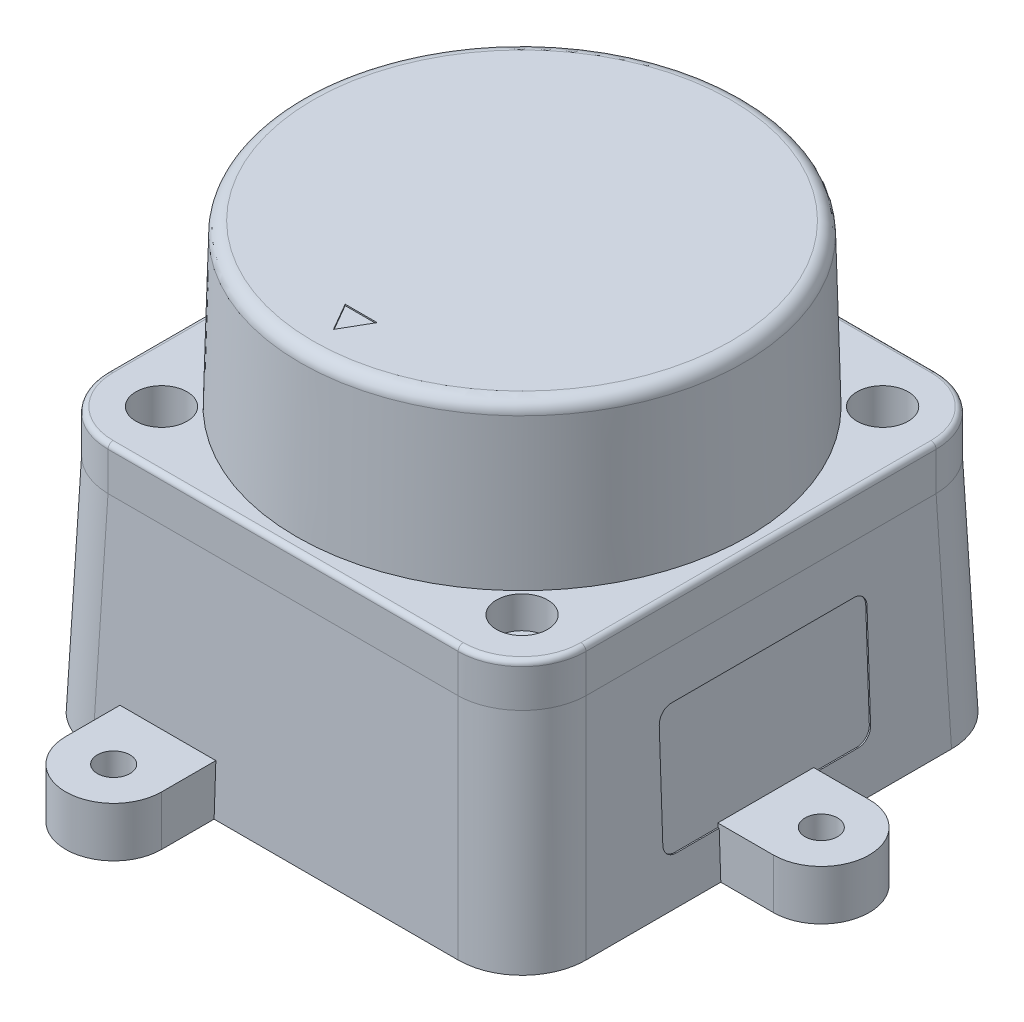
ISO-10303-21;
HEADER;
FILE_DESCRIPTION(('STEP AP214'),'2;1');
FILE_NAME('part.step','',(''),(''),'','','');
FILE_SCHEMA(('AUTOMOTIVE_DESIGN { 1 0 10303 214 1 1 1 1 }'));
ENDSEC;
DATA;
#1=APPLICATION_CONTEXT('core data for automotive mechanical design processes');
#2=APPLICATION_PROTOCOL_DEFINITION('international standard','automotive_design',2000,#1);
#3=PRODUCT_CONTEXT('',#1,'mechanical');
#4=PRODUCT('Part','Part','',(#3));
#5=PRODUCT_RELATED_PRODUCT_CATEGORY('part','',(#4));
#6=PRODUCT_DEFINITION_FORMATION('','',#4);
#7=PRODUCT_DEFINITION_CONTEXT('part definition',#1,'design');
#8=PRODUCT_DEFINITION('design','',#6,#7);
#9=PRODUCT_DEFINITION_SHAPE('','',#8);
#10=(LENGTH_UNIT() NAMED_UNIT(*) SI_UNIT(.MILLI.,.METRE.));
#11=(NAMED_UNIT(*) PLANE_ANGLE_UNIT() SI_UNIT($,.RADIAN.));
#12=(NAMED_UNIT(*) SI_UNIT($,.STERADIAN.) SOLID_ANGLE_UNIT());
#13=UNCERTAINTY_MEASURE_WITH_UNIT(LENGTH_MEASURE(1.E-05),#10,'distance_accuracy_value','');
#14=(GEOMETRIC_REPRESENTATION_CONTEXT(3) GLOBAL_UNCERTAINTY_ASSIGNED_CONTEXT((#13)) GLOBAL_UNIT_ASSIGNED_CONTEXT((#10,
#11,#12)) REPRESENTATION_CONTEXT('',''));
#15=CARTESIAN_POINT('',(0.,0.,0.));
#16=DIRECTION('',(0.,0.,1.));
#17=DIRECTION('',(1.,0.,0.));
#18=AXIS2_PLACEMENT_3D('',#15,#16,#17);
#19=CARTESIAN_POINT('',(19.0692852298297,3.6,-19.295));
#20=DIRECTION('',(0.,1.,0.));
#21=DIRECTION('',(0.,0.,1.));
#22=AXIS2_PLACEMENT_3D('',#19,#20,#21);
#23=PLANE('',#22);
#24=DIRECTION('',(-1.,0.,0.));
#25=VECTOR('',#24,1.);
#26=CARTESIAN_POINT('',(19.0692852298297,3.6,-3.75));
#27=LINE('',#26,#25);
#28=CARTESIAN_POINT('',(19.1692852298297,3.6,-3.75));
#29=VERTEX_POINT('',#28);
#30=CARTESIAN_POINT('',(19.0692852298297,3.6,-3.75));
#31=VERTEX_POINT('',#30);
#32=EDGE_CURVE('E390',#29,#31,#27,.T.);
#33=ORIENTED_EDGE('',*,*,#32,.F.);
#34=DIRECTION('',(0.,0.,1.));
#35=VECTOR('',#34,1.);
#36=CARTESIAN_POINT('',(19.1692852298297,3.6,-19.295));
#37=LINE('',#36,#35);
#38=CARTESIAN_POINT('',(19.1692852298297,3.6,-7.125));
#39=VERTEX_POINT('',#38);
#40=EDGE_CURVE('E539',#39,#29,#37,.T.);
#41=ORIENTED_EDGE('',*,*,#40,.F.);
#42=DIRECTION('',(1.,0.,0.));
#43=VECTOR('',#42,1.);
#44=CARTESIAN_POINT('',(19.0692852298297,3.6,-7.125));
#45=LINE('',#44,#43);
#46=CARTESIAN_POINT('',(19.0692852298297,3.6,-7.125));
#47=VERTEX_POINT('',#46);
#48=EDGE_CURVE('E783',#39,#47,#45,.F.);
#49=ORIENTED_EDGE('',*,*,#48,.T.);
#50=DIRECTION('',(0.,0.,1.));
#51=VECTOR('',#50,1.);
#52=CARTESIAN_POINT('',(19.0692852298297,3.6,-19.295));
#53=LINE('',#52,#51);
#54=EDGE_CURVE('E525',#47,#31,#53,.T.);
#55=ORIENTED_EDGE('',*,*,#54,.T.);
#56=EDGE_LOOP('',(#33,#41,#49,#55));
#57=FACE_BOUND('',#56,.T.);
#58=ADVANCED_FACE('F40',(#57),#23,.T.);
#59=CARTESIAN_POINT('',(19.295,0.,-19.295));
#60=DIRECTION('',(0.999390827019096,0.034899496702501,0.));
#61=DIRECTION('',(-0.034899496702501,0.999390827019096,0.));
#62=AXIS2_PLACEMENT_3D('',#59,#60,#61);
#63=PLANE('',#62);
#64=ORIENTED_EDGE('',*,*,#40,.T.);
#65=DIRECTION('',(-0.034899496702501,0.999390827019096,0.));
#66=VECTOR('',#65,1.);
#67=CARTESIAN_POINT('',(19.295,0.,-3.75));
#68=LINE('',#67,#66);
#69=CARTESIAN_POINT('',(19.295,0.,-3.75));
#70=VERTEX_POINT('',#69);
#71=EDGE_CURVE('E392',#29,#70,#68,.F.);
#72=ORIENTED_EDGE('',*,*,#71,.T.);
#73=DIRECTION('',(0.,0.,-1.));
#74=VECTOR('',#73,1.);
#75=CARTESIAN_POINT('',(19.295,0.,-19.295));
#76=LINE('',#75,#74);
#77=CARTESIAN_POINT('',(19.295,0.,-14.2980458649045));
#78=VERTEX_POINT('',#77);
#79=EDGE_CURVE('E607',#70,#78,#76,.T.);
#80=ORIENTED_EDGE('',*,*,#79,.T.);
#81=DIRECTION('',(-0.0348782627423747,0.998782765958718,0.0348782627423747));
#82=VECTOR('',#81,1.);
#83=CARTESIAN_POINT('',(19.3010787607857,-0.174072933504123,-14.3041246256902));
#84=LINE('',#83,#82);
#85=CARTESIAN_POINT('',(18.6908697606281,17.3000265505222,-13.6939156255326));
#86=VERTEX_POINT('',#85);
#87=EDGE_CURVE('E662',#78,#86,#84,.T.);
#88=ORIENTED_EDGE('',*,*,#87,.T.);
#89=CARTESIAN_POINT('',(13.6908706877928,160.481266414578,-13.6908706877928));
#90=DIRECTION('',(0.999390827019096,0.034899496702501,0.));
#91=DIRECTION('',(0.034899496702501,-0.999390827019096,0.));
#92=AXIS2_PLACEMENT_3D('',#89,#90,#91);
#93=ELLIPSE('',#92,143.268541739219,5.);
#94=CARTESIAN_POINT('',(18.6908706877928,17.3,-13.6908706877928));
#95=VERTEX_POINT('',#94);
#96=EDGE_CURVE('E682',#86,#95,#93,.F.);
#97=ORIENTED_EDGE('',*,*,#96,.T.);
#98=DIRECTION('',(0.,0.,1.));
#99=VECTOR('',#98,1.);
#100=CARTESIAN_POINT('',(18.6908706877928,17.3,-19.295));
#101=LINE('',#100,#99);
#102=CARTESIAN_POINT('',(18.6908706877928,17.3,13.6908706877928));
#103=VERTEX_POINT('',#102);
#104=EDGE_CURVE('E620',#103,#95,#101,.F.);
#105=ORIENTED_EDGE('',*,*,#104,.F.);
#106=CARTESIAN_POINT('',(13.6908706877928,160.481266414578,13.6908706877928));
#107=DIRECTION('',(0.999390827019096,0.034899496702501,0.));
#108=DIRECTION('',(0.034899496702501,-0.999390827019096,0.));
#109=AXIS2_PLACEMENT_3D('',#106,#107,#108);
#110=ELLIPSE('',#109,143.268541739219,5.);
#111=CARTESIAN_POINT('',(18.6908697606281,17.3000265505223,13.6939156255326));
#112=VERTEX_POINT('',#111);
#113=EDGE_CURVE('E689',#103,#112,#110,.F.);
#114=ORIENTED_EDGE('',*,*,#113,.T.);
#115=DIRECTION('',(-0.0348782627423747,0.998782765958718,-0.0348782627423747));
#116=VECTOR('',#115,1.);
#117=CARTESIAN_POINT('',(19.2541342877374,1.17024088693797,14.2571801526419));
#118=LINE('',#117,#116);
#119=CARTESIAN_POINT('',(19.295,0.,14.2980458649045));
#120=VERTEX_POINT('',#119);
#121=EDGE_CURVE('E659',#112,#120,#118,.F.);
#122=ORIENTED_EDGE('',*,*,#121,.T.);
#123=CARTESIAN_POINT('',(19.295,0.,3.75));
#124=VERTEX_POINT('',#123);
#125=EDGE_CURVE('E608',#120,#124,#76,.T.);
#126=ORIENTED_EDGE('',*,*,#125,.T.);
#127=DIRECTION('',(0.034899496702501,-0.999390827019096,0.));
#128=VECTOR('',#127,1.);
#129=CARTESIAN_POINT('',(19.295,0.,3.75));
#130=LINE('',#129,#128);
#131=CARTESIAN_POINT('',(19.1692852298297,3.6,3.75));
#132=VERTEX_POINT('',#131);
#133=EDGE_CURVE('E387',#124,#132,#130,.F.);
#134=ORIENTED_EDGE('',*,*,#133,.T.);
#135=CARTESIAN_POINT('',(19.1692852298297,3.6,7.12499999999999));
#136=VERTEX_POINT('',#135);
#137=EDGE_CURVE('E516',#132,#136,#37,.T.);
#138=ORIENTED_EDGE('',*,*,#137,.T.);
#139=CARTESIAN_POINT('',(19.134364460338,4.6,7.125));
#140=DIRECTION('',(0.999390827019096,0.034899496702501,0.));
#141=DIRECTION('',(-0.034899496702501,0.999390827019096,0.));
#142=AXIS2_PLACEMENT_3D('',#139,#140,#141);
#143=ELLIPSE('',#142,1.00060954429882,1.);
#144=CARTESIAN_POINT('',(19.134364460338,4.6,8.125));
#145=VERTEX_POINT('',#144);
#146=EDGE_CURVE('E810',#136,#145,#143,.F.);
#147=ORIENTED_EDGE('',*,*,#146,.T.);
#148=DIRECTION('',(-0.034899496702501,0.999390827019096,0.));
#149=VECTOR('',#148,1.);
#150=CARTESIAN_POINT('',(19.295,0.,8.125));
#151=LINE('',#150,#149);
#152=CARTESIAN_POINT('',(18.854998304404,12.6,8.125));
#153=VERTEX_POINT('',#152);
#154=EDGE_CURVE('E542',#145,#153,#151,.T.);
#155=ORIENTED_EDGE('',*,*,#154,.T.);
#156=CARTESIAN_POINT('',(18.854998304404,12.6,7.125));
#157=DIRECTION('',(0.999390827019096,0.034899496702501,0.));
#158=DIRECTION('',(-0.034899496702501,0.999390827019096,0.));
#159=AXIS2_PLACEMENT_3D('',#156,#157,#158);
#160=ELLIPSE('',#159,1.00060954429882,1.);
#161=CARTESIAN_POINT('',(18.8200775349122,13.6,7.12499999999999));
#162=VERTEX_POINT('',#161);
#163=EDGE_CURVE('E808',#153,#162,#160,.F.);
#164=ORIENTED_EDGE('',*,*,#163,.T.);
#165=DIRECTION('',(0.,0.,-1.));
#166=VECTOR('',#165,1.);
#167=CARTESIAN_POINT('',(18.8200775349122,13.6,-19.295));
#168=LINE('',#167,#166);
#169=CARTESIAN_POINT('',(18.8200775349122,13.6,-7.125));
#170=VERTEX_POINT('',#169);
#171=EDGE_CURVE('E545',#162,#170,#168,.T.);
#172=ORIENTED_EDGE('',*,*,#171,.T.);
#173=CARTESIAN_POINT('',(18.854998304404,12.6,-7.125));
#174=DIRECTION('',(0.999390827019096,0.034899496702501,0.));
#175=DIRECTION('',(-0.034899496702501,0.999390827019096,0.));
#176=AXIS2_PLACEMENT_3D('',#173,#174,#175);
#177=ELLIPSE('',#176,1.00060954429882,1.);
#178=CARTESIAN_POINT('',(18.854998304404,12.6,-8.125));
#179=VERTEX_POINT('',#178);
#180=EDGE_CURVE('E806',#170,#179,#177,.F.);
#181=ORIENTED_EDGE('',*,*,#180,.T.);
#182=DIRECTION('',(0.034899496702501,-0.999390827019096,0.));
#183=VECTOR('',#182,1.);
#184=CARTESIAN_POINT('',(19.295,0.,-8.125));
#185=LINE('',#184,#183);
#186=CARTESIAN_POINT('',(19.134364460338,4.6,-8.125));
#187=VERTEX_POINT('',#186);
#188=EDGE_CURVE('E548',#179,#187,#185,.T.);
#189=ORIENTED_EDGE('',*,*,#188,.T.);
#190=CARTESIAN_POINT('',(19.134364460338,4.6,-7.125));
#191=DIRECTION('',(0.999390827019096,0.034899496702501,0.));
#192=DIRECTION('',(-0.034899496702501,0.999390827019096,0.));
#193=AXIS2_PLACEMENT_3D('',#190,#191,#192);
#194=ELLIPSE('',#193,1.00060954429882,1.);
#195=EDGE_CURVE('E804',#187,#39,#194,.F.);
#196=ORIENTED_EDGE('',*,*,#195,.T.);
#197=EDGE_LOOP('',(#64,#72,#80,#88,#97,#105,#114,#122,#126,#134,#138,#147,#155,#164,#172,#181,
#189,#196));
#198=FACE_BOUND('',#197,.T.);
#199=ADVANCED_FACE('F826',(#198),#63,.T.);
#200=CARTESIAN_POINT('',(-19.295,0.,-19.295));
#201=DIRECTION('',(-0.999390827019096,0.034899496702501,0.));
#202=DIRECTION('',(-0.034899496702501,-0.999390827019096,0.));
#203=AXIS2_PLACEMENT_3D('',#200,#201,#202);
#204=PLANE('',#203);
#205=DIRECTION('',(0.,0.,-1.));
#206=VECTOR('',#205,1.);
#207=CARTESIAN_POINT('',(-18.6908706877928,17.3,-19.295));
#208=LINE('',#207,#206);
#209=CARTESIAN_POINT('',(-18.6908706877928,17.3,-13.6908706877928));
#210=VERTEX_POINT('',#209);
#211=CARTESIAN_POINT('',(-18.6908706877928,17.3,13.6908706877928));
#212=VERTEX_POINT('',#211);
#213=EDGE_CURVE('E614',#210,#212,#208,.F.);
#214=ORIENTED_EDGE('',*,*,#213,.F.);
#215=CARTESIAN_POINT('',(-13.6908706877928,160.481266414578,-13.6908706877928));
#216=DIRECTION('',(-0.999390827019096,0.034899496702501,0.));
#217=DIRECTION('',(-0.034899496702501,-0.999390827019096,0.));
#218=AXIS2_PLACEMENT_3D('',#215,#216,#217);
#219=ELLIPSE('',#218,143.268541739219,5.);
#220=CARTESIAN_POINT('',(-18.6908697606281,17.3000265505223,-13.6939156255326));
#221=VERTEX_POINT('',#220);
#222=EDGE_CURVE('E674',#210,#221,#219,.F.);
#223=ORIENTED_EDGE('',*,*,#222,.T.);
#224=DIRECTION('',(0.0348782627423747,0.998782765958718,0.0348782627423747));
#225=VECTOR('',#224,1.);
#226=CARTESIAN_POINT('',(-19.3010787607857,-0.174072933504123,-14.3041246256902));
#227=LINE('',#226,#225);
#228=CARTESIAN_POINT('',(-19.295,0.,-14.2980458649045));
#229=VERTEX_POINT('',#228);
#230=EDGE_CURVE('E626',#221,#229,#227,.F.);
#231=ORIENTED_EDGE('',*,*,#230,.T.);
#232=DIRECTION('',(0.,0.,1.));
#233=VECTOR('',#232,1.);
#234=CARTESIAN_POINT('',(-19.295,0.,-19.295));
#235=LINE('',#234,#233);
#236=CARTESIAN_POINT('',(-19.295,0.,14.2980458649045));
#237=VERTEX_POINT('',#236);
#238=EDGE_CURVE('E600',#229,#237,#235,.T.);
#239=ORIENTED_EDGE('',*,*,#238,.T.);
#240=DIRECTION('',(0.0348782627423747,0.998782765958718,-0.0348782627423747));
#241=VECTOR('',#240,1.);
#242=CARTESIAN_POINT('',(-19.2541342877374,1.17024088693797,14.2571801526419));
#243=LINE('',#242,#241);
#244=CARTESIAN_POINT('',(-18.6908697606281,17.3000265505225,13.6939156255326));
#245=VERTEX_POINT('',#244);
#246=EDGE_CURVE('E598',#237,#245,#243,.T.);
#247=ORIENTED_EDGE('',*,*,#246,.T.);
#248=CARTESIAN_POINT('',(-13.6908706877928,160.481266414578,13.6908706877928));
#249=DIRECTION('',(-0.999390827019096,0.034899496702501,0.));
#250=DIRECTION('',(-0.034899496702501,-0.999390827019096,0.));
#251=AXIS2_PLACEMENT_3D('',#248,#249,#250);
#252=ELLIPSE('',#251,143.268541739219,5.);
#253=EDGE_CURVE('E687',#245,#212,#252,.F.);
#254=ORIENTED_EDGE('',*,*,#253,.T.);
#255=EDGE_LOOP('',(#214,#223,#231,#239,#247,#254));
#256=FACE_BOUND('',#255,.T.);
#257=DIRECTION('',(-0.034899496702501,-0.999390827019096,0.));
#258=VECTOR('',#257,1.);
#259=CARTESIAN_POINT('',(-19.295,0.,4.625));
#260=LINE('',#259,#258);
#261=CARTESIAN_POINT('',(-19.2391267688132,1.6,4.625));
#262=VERTEX_POINT('',#261);
#263=CARTESIAN_POINT('',(-19.0907134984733,5.85,4.625));
#264=VERTEX_POINT('',#263);
#265=EDGE_CURVE('E772',#262,#264,#260,.F.);
#266=ORIENTED_EDGE('',*,*,#265,.F.);
#267=DIRECTION('',(0.,0.,-1.));
#268=VECTOR('',#267,1.);
#269=CARTESIAN_POINT('',(-19.2391267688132,1.6,-19.295));
#270=LINE('',#269,#268);
#271=CARTESIAN_POINT('',(-19.2391267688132,1.6,-4.625));
#272=VERTEX_POINT('',#271);
#273=EDGE_CURVE('E770',#272,#262,#270,.F.);
#274=ORIENTED_EDGE('',*,*,#273,.F.);
#275=DIRECTION('',(0.034899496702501,0.999390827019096,0.));
#276=VECTOR('',#275,1.);
#277=CARTESIAN_POINT('',(-19.295,0.,-4.625));
#278=LINE('',#277,#276);
#279=CARTESIAN_POINT('',(-19.0907134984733,5.85,-4.625));
#280=VERTEX_POINT('',#279);
#281=EDGE_CURVE('E768',#280,#272,#278,.F.);
#282=ORIENTED_EDGE('',*,*,#281,.F.);
#283=DIRECTION('',(0.,0.,1.));
#284=VECTOR('',#283,1.);
#285=CARTESIAN_POINT('',(-19.0907134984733,5.85,-19.295));
#286=LINE('',#285,#284);
#287=EDGE_CURVE('E766',#264,#280,#286,.F.);
#288=ORIENTED_EDGE('',*,*,#287,.F.);
#289=EDGE_LOOP('',(#266,#274,#282,#288));
#290=FACE_BOUND('',#289,.T.);
#291=ADVANCED_FACE('F949',(#256,#290),#204,.T.);
#292=CARTESIAN_POINT('',(-19.295,0.,19.295));
#293=DIRECTION('',(0.,0.034899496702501,0.999390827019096));
#294=DIRECTION('',(0.,-0.999390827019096,0.034899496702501));
#295=AXIS2_PLACEMENT_3D('',#292,#293,#294);
#296=PLANE('',#295);
#297=DIRECTION('',(1.,0.,0.));
#298=VECTOR('',#297,1.);
#299=CARTESIAN_POINT('',(-19.295,0.,19.295));
#300=LINE('',#299,#298);
#301=CARTESIAN_POINT('',(-14.2980458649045,0.,19.295));
#302=VERTEX_POINT('',#301);
#303=CARTESIAN_POINT('',(-12.2918308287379,0.,19.295));
#304=VERTEX_POINT('',#303);
#305=EDGE_CURVE('E605',#302,#304,#300,.T.);
#306=ORIENTED_EDGE('',*,*,#305,.T.);
#307=DIRECTION('',(0.,-0.999390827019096,0.034899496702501));
#308=VECTOR('',#307,1.);
#309=CARTESIAN_POINT('',(-12.2918308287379,0.,19.295));
#310=LINE('',#309,#308);
#311=CARTESIAN_POINT('',(-12.2918308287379,3.9,19.1588089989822));
#312=VERTEX_POINT('',#311);
#313=EDGE_CURVE('E456',#304,#312,#310,.F.);
#314=ORIENTED_EDGE('',*,*,#313,.T.);
#315=DIRECTION('',(-1.,0.,0.));
#316=VECTOR('',#315,1.);
#317=CARTESIAN_POINT('',(-19.295,3.9,19.1588089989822));
#318=LINE('',#317,#316);
#319=CARTESIAN_POINT('',(-4.79183082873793,3.9,19.1588089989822));
#320=VERTEX_POINT('',#319);
#321=EDGE_CURVE('E812',#312,#320,#318,.F.);
#322=ORIENTED_EDGE('',*,*,#321,.T.);
#323=DIRECTION('',(0.,0.999390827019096,-0.034899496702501));
#324=VECTOR('',#323,1.);
#325=CARTESIAN_POINT('',(-4.79183082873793,0.,19.295));
#326=LINE('',#325,#324);
#327=CARTESIAN_POINT('',(-4.79183082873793,0.,19.295));
#328=VERTEX_POINT('',#327);
#329=EDGE_CURVE('E451',#320,#328,#326,.F.);
#330=ORIENTED_EDGE('',*,*,#329,.T.);
#331=CARTESIAN_POINT('',(14.2980458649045,0.,19.295));
#332=VERTEX_POINT('',#331);
#333=EDGE_CURVE('E603',#328,#332,#300,.T.);
#334=ORIENTED_EDGE('',*,*,#333,.T.);
#335=DIRECTION('',(-0.0348782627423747,0.998782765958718,-0.0348782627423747));
#336=VECTOR('',#335,1.);
#337=CARTESIAN_POINT('',(14.2571801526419,1.17024088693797,19.2541342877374));
#338=LINE('',#337,#336);
#339=CARTESIAN_POINT('',(13.6939156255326,17.300026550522,18.6908697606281));
#340=VERTEX_POINT('',#339);
#341=EDGE_CURVE('E664',#332,#340,#338,.T.);
#342=ORIENTED_EDGE('',*,*,#341,.T.);
#343=CARTESIAN_POINT('',(13.6908706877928,160.481266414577,13.6908706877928));
#344=DIRECTION('',(0.,0.034899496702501,0.999390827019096));
#345=DIRECTION('',(0.,-0.999390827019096,0.034899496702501));
#346=AXIS2_PLACEMENT_3D('',#343,#344,#345);
#347=ELLIPSE('',#346,143.268541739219,5.);
#348=CARTESIAN_POINT('',(13.6908706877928,17.3,18.6908706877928));
#349=VERTEX_POINT('',#348);
#350=EDGE_CURVE('E692',#340,#349,#347,.F.);
#351=ORIENTED_EDGE('',*,*,#350,.T.);
#352=DIRECTION('',(-1.,0.,0.));
#353=VECTOR('',#352,1.);
#354=CARTESIAN_POINT('',(-19.295,17.3,18.6908706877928));
#355=LINE('',#354,#353);
#356=CARTESIAN_POINT('',(-13.6908706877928,17.3,18.6908706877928));
#357=VERTEX_POINT('',#356);
#358=EDGE_CURVE('E617',#357,#349,#355,.F.);
#359=ORIENTED_EDGE('',*,*,#358,.F.);
#360=CARTESIAN_POINT('',(-13.6908706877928,160.481266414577,13.6908706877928));
#361=DIRECTION('',(0.,0.034899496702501,0.999390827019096));
#362=DIRECTION('',(0.,-0.999390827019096,0.034899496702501));
#363=AXIS2_PLACEMENT_3D('',#360,#361,#362);
#364=ELLIPSE('',#363,143.268541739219,5.);
#365=CARTESIAN_POINT('',(-13.6939156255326,17.300026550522,18.6908697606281));
#366=VERTEX_POINT('',#365);
#367=EDGE_CURVE('E684',#357,#366,#364,.F.);
#368=ORIENTED_EDGE('',*,*,#367,.T.);
#369=DIRECTION('',(0.0348782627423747,0.998782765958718,-0.0348782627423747));
#370=VECTOR('',#369,1.);
#371=CARTESIAN_POINT('',(-14.3041246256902,-0.174072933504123,19.3010787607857));
#372=LINE('',#371,#370);
#373=EDGE_CURVE('E666',#366,#302,#372,.F.);
#374=ORIENTED_EDGE('',*,*,#373,.T.);
#375=EDGE_LOOP('',(#306,#314,#322,#330,#334,#342,#351,#359,#368,#374));
#376=FACE_BOUND('',#375,.T.);
#377=ADVANCED_FACE('F958',(#376),#296,.T.);
#378=CARTESIAN_POINT('',(-19.295,0.,-19.295));
#379=DIRECTION('',(0.,0.034899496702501,-0.999390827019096));
#380=DIRECTION('',(0.,0.999390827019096,0.034899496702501));
#381=AXIS2_PLACEMENT_3D('',#378,#379,#380);
#382=PLANE('',#381);
#383=DIRECTION('',(-1.,0.,0.));
#384=VECTOR('',#383,1.);
#385=CARTESIAN_POINT('',(-19.295,0.,-19.295));
#386=LINE('',#385,#384);
#387=CARTESIAN_POINT('',(14.2980458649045,0.,-19.295));
#388=VERTEX_POINT('',#387);
#389=CARTESIAN_POINT('',(-4.79183082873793,0.,-19.295));
#390=VERTEX_POINT('',#389);
#391=EDGE_CURVE('E612',#388,#390,#386,.T.);
#392=ORIENTED_EDGE('',*,*,#391,.T.);
#393=DIRECTION('',(0.,-0.999390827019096,-0.034899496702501));
#394=VECTOR('',#393,1.);
#395=CARTESIAN_POINT('',(-4.79183082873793,0.,-19.295));
#396=LINE('',#395,#394);
#397=CARTESIAN_POINT('',(-4.79183082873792,3.9,-19.1588089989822));
#398=VERTEX_POINT('',#397);
#399=EDGE_CURVE('E63',#390,#398,#396,.F.);
#400=ORIENTED_EDGE('',*,*,#399,.T.);
#401=DIRECTION('',(-1.,0.,0.));
#402=VECTOR('',#401,1.);
#403=CARTESIAN_POINT('',(-19.295,3.9,-19.1588089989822));
#404=LINE('',#403,#402);
#405=CARTESIAN_POINT('',(-12.2918308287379,3.9,-19.1588089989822));
#406=VERTEX_POINT('',#405);
#407=EDGE_CURVE('E814',#406,#398,#404,.F.);
#408=ORIENTED_EDGE('',*,*,#407,.F.);
#409=DIRECTION('',(0.,0.999390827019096,0.034899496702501));
#410=VECTOR('',#409,1.);
#411=CARTESIAN_POINT('',(-12.2918308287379,0.,-19.295));
#412=LINE('',#411,#410);
#413=CARTESIAN_POINT('',(-12.2918308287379,0.,-19.295));
#414=VERTEX_POINT('',#413);
#415=EDGE_CURVE('E420',#406,#414,#412,.F.);
#416=ORIENTED_EDGE('',*,*,#415,.T.);
#417=CARTESIAN_POINT('',(-14.2980458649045,0.,-19.295));
#418=VERTEX_POINT('',#417);
#419=EDGE_CURVE('E611',#414,#418,#386,.T.);
#420=ORIENTED_EDGE('',*,*,#419,.T.);
#421=DIRECTION('',(0.0348782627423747,0.998782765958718,0.0348782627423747));
#422=VECTOR('',#421,1.);
#423=CARTESIAN_POINT('',(-14.3041246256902,-0.174072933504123,-19.3010787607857));
#424=LINE('',#423,#422);
#425=CARTESIAN_POINT('',(-13.6939156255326,17.3000265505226,-18.6908697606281));
#426=VERTEX_POINT('',#425);
#427=EDGE_CURVE('E642',#418,#426,#424,.T.);
#428=ORIENTED_EDGE('',*,*,#427,.T.);
#429=CARTESIAN_POINT('',(-13.6908706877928,160.481266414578,-13.6908706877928));
#430=DIRECTION('',(0.,0.034899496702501,-0.999390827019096));
#431=DIRECTION('',(0.,-0.999390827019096,-0.034899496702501));
#432=AXIS2_PLACEMENT_3D('',#429,#430,#431);
#433=ELLIPSE('',#432,143.268541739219,5.);
#434=CARTESIAN_POINT('',(-13.6908706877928,17.3,-18.6908706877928));
#435=VERTEX_POINT('',#434);
#436=EDGE_CURVE('E677',#426,#435,#433,.F.);
#437=ORIENTED_EDGE('',*,*,#436,.T.);
#438=DIRECTION('',(1.,0.,0.));
#439=VECTOR('',#438,1.);
#440=CARTESIAN_POINT('',(-19.295,17.3,-18.6908706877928));
#441=LINE('',#440,#439);
#442=CARTESIAN_POINT('',(13.6908706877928,17.3,-18.6908706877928));
#443=VERTEX_POINT('',#442);
#444=EDGE_CURVE('E599',#443,#435,#441,.F.);
#445=ORIENTED_EDGE('',*,*,#444,.F.);
#446=CARTESIAN_POINT('',(13.6908706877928,160.481266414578,-13.6908706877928));
#447=DIRECTION('',(0.,0.034899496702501,-0.999390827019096));
#448=DIRECTION('',(0.,-0.999390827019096,-0.034899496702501));
#449=AXIS2_PLACEMENT_3D('',#446,#447,#448);
#450=ELLIPSE('',#449,143.268541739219,5.);
#451=CARTESIAN_POINT('',(13.6939156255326,17.3000265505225,-18.6908697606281));
#452=VERTEX_POINT('',#451);
#453=EDGE_CURVE('E679',#443,#452,#450,.F.);
#454=ORIENTED_EDGE('',*,*,#453,.T.);
#455=DIRECTION('',(-0.0348782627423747,0.998782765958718,0.0348782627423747));
#456=VECTOR('',#455,1.);
#457=CARTESIAN_POINT('',(14.2571801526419,1.17024088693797,-19.2541342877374));
#458=LINE('',#457,#456);
#459=EDGE_CURVE('E640',#452,#388,#458,.F.);
#460=ORIENTED_EDGE('',*,*,#459,.T.);
#461=EDGE_LOOP('',(#392,#400,#408,#416,#420,#428,#437,#445,#454,#460));
#462=FACE_BOUND('',#461,.T.);
#463=ADVANCED_FACE('F1070',(#462),#382,.T.);
#464=CARTESIAN_POINT('',(0.,0.,0.));
#465=DIRECTION('',(0.,1.,0.));
#466=DIRECTION('',(0.,0.,1.));
#467=AXIS2_PLACEMENT_3D('',#464,#465,#466);
#468=PLANE('',#467);
#469=ORIENTED_EDGE('',*,*,#79,.F.);
#470=DIRECTION('',(1.,0.,0.));
#471=VECTOR('',#470,1.);
#472=CARTESIAN_POINT('',(18.295,0.,-3.75));
#473=LINE('',#472,#471);
#474=CARTESIAN_POINT('',(23.405,0.,-3.75));
#475=VERTEX_POINT('',#474);
#476=EDGE_CURVE('E372',#70,#475,#473,.T.);
#477=ORIENTED_EDGE('',*,*,#476,.T.);
#478=CARTESIAN_POINT('',(23.405,0.,0.));
#479=DIRECTION('',(0.,-1.,0.));
#480=DIRECTION('',(0.,0.,1.));
#481=AXIS2_PLACEMENT_3D('',#478,#479,#480);
#482=CIRCLE('',#481,3.75);
#483=CARTESIAN_POINT('',(23.405,0.,3.75));
#484=VERTEX_POINT('',#483);
#485=EDGE_CURVE('E380',#475,#484,#482,.T.);
#486=ORIENTED_EDGE('',*,*,#485,.T.);
#487=DIRECTION('',(-1.,0.,0.));
#488=VECTOR('',#487,1.);
#489=CARTESIAN_POINT('',(23.405,0.,3.75));
#490=LINE('',#489,#488);
#491=EDGE_CURVE('E357',#484,#124,#490,.T.);
#492=ORIENTED_EDGE('',*,*,#491,.T.);
#493=ORIENTED_EDGE('',*,*,#125,.F.);
#494=CARTESIAN_POINT('',(14.2919522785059,0.,14.2919522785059));
#495=DIRECTION('',(0.,1.,0.));
#496=DIRECTION('',(0.707106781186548,0.,0.707106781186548));
#497=AXIS2_PLACEMENT_3D('',#494,#495,#496);
#498=ELLIPSE('',#497,5.00609358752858,5.);
#499=EDGE_CURVE('E629',#120,#332,#498,.F.);
#500=ORIENTED_EDGE('',*,*,#499,.T.);
#501=ORIENTED_EDGE('',*,*,#333,.F.);
#502=DIRECTION('',(0.,0.,1.));
#503=VECTOR('',#502,1.);
#504=CARTESIAN_POINT('',(-4.79183082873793,0.,18.295));
#505=LINE('',#504,#503);
#506=CARTESIAN_POINT('',(-4.79183082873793,0.,23.4));
#507=VERTEX_POINT('',#506);
#508=EDGE_CURVE('E430',#328,#507,#505,.T.);
#509=ORIENTED_EDGE('',*,*,#508,.T.);
#510=CARTESIAN_POINT('',(-8.54183082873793,0.,23.4));
#511=DIRECTION('',(0.,-1.,0.));
#512=DIRECTION('',(0.,0.,1.));
#513=AXIS2_PLACEMENT_3D('',#510,#511,#512);
#514=CIRCLE('',#513,3.75);
#515=CARTESIAN_POINT('',(-12.2918308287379,0.,23.4));
#516=VERTEX_POINT('',#515);
#517=EDGE_CURVE('E444',#507,#516,#514,.T.);
#518=ORIENTED_EDGE('',*,*,#517,.T.);
#519=DIRECTION('',(0.,0.,-1.));
#520=VECTOR('',#519,1.);
#521=CARTESIAN_POINT('',(-12.2918308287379,0.,18.295));
#522=LINE('',#521,#520);
#523=EDGE_CURVE('E436',#516,#304,#522,.T.);
#524=ORIENTED_EDGE('',*,*,#523,.T.);
#525=ORIENTED_EDGE('',*,*,#305,.F.);
#526=CARTESIAN_POINT('',(-14.2919522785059,0.,14.2919522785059));
#527=DIRECTION('',(0.,1.,0.));
#528=DIRECTION('',(-0.707106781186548,0.,0.707106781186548));
#529=AXIS2_PLACEMENT_3D('',#526,#527,#528);
#530=ELLIPSE('',#529,5.00609358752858,5.);
#531=EDGE_CURVE('E632',#302,#237,#530,.F.);
#532=ORIENTED_EDGE('',*,*,#531,.T.);
#533=ORIENTED_EDGE('',*,*,#238,.F.);
#534=CARTESIAN_POINT('',(-14.2919522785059,0.,-14.2919522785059));
#535=DIRECTION('',(0.,1.,0.));
#536=DIRECTION('',(-0.707106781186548,0.,-0.707106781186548));
#537=AXIS2_PLACEMENT_3D('',#534,#535,#536);
#538=ELLIPSE('',#537,5.00609358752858,5.);
#539=EDGE_CURVE('E637',#229,#418,#538,.F.);
#540=ORIENTED_EDGE('',*,*,#539,.T.);
#541=ORIENTED_EDGE('',*,*,#419,.F.);
#542=DIRECTION('',(0.,0.,-1.));
#543=VECTOR('',#542,1.);
#544=CARTESIAN_POINT('',(-12.2918308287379,0.,-18.295));
#545=LINE('',#544,#543);
#546=CARTESIAN_POINT('',(-12.2918308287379,0.,-23.4));
#547=VERTEX_POINT('',#546);
#548=EDGE_CURVE('E399',#414,#547,#545,.T.);
#549=ORIENTED_EDGE('',*,*,#548,.T.);
#550=CARTESIAN_POINT('',(-8.54183082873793,0.,-23.4));
#551=DIRECTION('',(0.,-1.,0.));
#552=DIRECTION('',(0.,0.,-1.));
#553=AXIS2_PLACEMENT_3D('',#550,#551,#552);
#554=CIRCLE('',#553,3.75);
#555=CARTESIAN_POINT('',(-4.79183082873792,0.,-23.4));
#556=VERTEX_POINT('',#555);
#557=EDGE_CURVE('E413',#547,#556,#554,.T.);
#558=ORIENTED_EDGE('',*,*,#557,.T.);
#559=DIRECTION('',(0.,0.,1.));
#560=VECTOR('',#559,1.);
#561=CARTESIAN_POINT('',(-4.79183082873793,0.,-18.295));
#562=LINE('',#561,#560);
#563=EDGE_CURVE('E405',#556,#390,#562,.T.);
#564=ORIENTED_EDGE('',*,*,#563,.T.);
#565=ORIENTED_EDGE('',*,*,#391,.F.);
#566=CARTESIAN_POINT('',(14.2919522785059,0.,-14.2919522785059));
#567=DIRECTION('',(0.,1.,0.));
#568=DIRECTION('',(0.707106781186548,0.,-0.707106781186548));
#569=AXIS2_PLACEMENT_3D('',#566,#567,#568);
#570=ELLIPSE('',#569,5.00609358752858,5.);
#571=EDGE_CURVE('E634',#388,#78,#570,.F.);
#572=ORIENTED_EDGE('',*,*,#571,.T.);
#573=EDGE_LOOP('',(#469,#477,#486,#492,#493,#500,#501,#509,#518,#524,#525,#532,#533,#540,#541,
#549,#558,#564,#565,#572));
#574=FACE_BOUND('',#573,.T.);
#575=CARTESIAN_POINT('',(-15.7,0.,-15.7));
#576=DIRECTION('',(0.,-1.,0.));
#577=DIRECTION('',(0.,0.,-1.));
#578=AXIS2_PLACEMENT_3D('',#575,#576,#577);
#579=CIRCLE('',#578,1.25);
#580=CARTESIAN_POINT('',(-15.7,0.,-16.95));
#581=VERTEX_POINT('',#580);
#582=EDGE_CURVE('E458',#581,#581,#579,.T.);
#583=ORIENTED_EDGE('',*,*,#582,.F.);
#584=EDGE_LOOP('',(#583));
#585=FACE_BOUND('',#584,.T.);
#586=CARTESIAN_POINT('',(-14.1,0.,14.1));
#587=DIRECTION('',(0.,1.,0.));
#588=DIRECTION('',(0.,0.,1.));
#589=AXIS2_PLACEMENT_3D('',#586,#587,#588);
#590=CIRCLE('',#589,2.4);
#591=CARTESIAN_POINT('',(-14.1,0.,16.5));
#592=VERTEX_POINT('',#591);
#593=EDGE_CURVE('E465',#592,#592,#590,.T.);
#594=ORIENTED_EDGE('',*,*,#593,.T.);
#595=EDGE_LOOP('',(#594));
#596=FACE_BOUND('',#595,.T.);
#597=CARTESIAN_POINT('',(14.1,0.,-14.1));
#598=DIRECTION('',(0.,1.,0.));
#599=DIRECTION('',(0.,0.,1.));
#600=AXIS2_PLACEMENT_3D('',#597,#598,#599);
#601=CIRCLE('',#600,2.4);
#602=CARTESIAN_POINT('',(14.1,0.,-11.7));
#603=VERTEX_POINT('',#602);
#604=EDGE_CURVE('E472',#603,#603,#601,.T.);
#605=ORIENTED_EDGE('',*,*,#604,.T.);
#606=EDGE_LOOP('',(#605));
#607=FACE_BOUND('',#606,.T.);
#608=CARTESIAN_POINT('',(-8.54183082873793,0.,23.4));
#609=DIRECTION('',(0.,-1.,0.));
#610=DIRECTION('',(0.,0.,-1.));
#611=AXIS2_PLACEMENT_3D('',#608,#609,#610);
#612=CIRCLE('',#611,1.275);
#613=CARTESIAN_POINT('',(-8.54183082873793,0.,22.125));
#614=VERTEX_POINT('',#613);
#615=EDGE_CURVE('E426',#614,#614,#612,.T.);
#616=ORIENTED_EDGE('',*,*,#615,.F.);
#617=EDGE_LOOP('',(#616));
#618=FACE_BOUND('',#617,.T.);
#619=CARTESIAN_POINT('',(-8.54183082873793,0.,-23.4));
#620=DIRECTION('',(0.,-1.,0.));
#621=DIRECTION('',(0.,0.,-1.));
#622=AXIS2_PLACEMENT_3D('',#619,#620,#621);
#623=CIRCLE('',#622,1.275);
#624=CARTESIAN_POINT('',(-8.54183082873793,0.,-24.675));
#625=VERTEX_POINT('',#624);
#626=EDGE_CURVE('E395',#625,#625,#623,.T.);
#627=ORIENTED_EDGE('',*,*,#626,.F.);
#628=EDGE_LOOP('',(#627));
#629=FACE_BOUND('',#628,.T.);
#630=CARTESIAN_POINT('',(23.405,0.,0.));
#631=DIRECTION('',(0.,-1.,0.));
#632=DIRECTION('',(0.,0.,-1.));
#633=AXIS2_PLACEMENT_3D('',#630,#631,#632);
#634=CIRCLE('',#633,1.275);
#635=CARTESIAN_POINT('',(23.405,0.,-1.275));
#636=VERTEX_POINT('',#635);
#637=EDGE_CURVE('E376',#636,#636,#634,.T.);
#638=ORIENTED_EDGE('',*,*,#637,.F.);
#639=EDGE_LOOP('',(#638));
#640=FACE_BOUND('',#639,.T.);
#641=ADVANCED_FACE('F865',(#574,#585,#596,#607,#618,#629,#640),#468,.F.);
#642=CARTESIAN_POINT('',(-18.6908706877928,20.7,-18.6908706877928));
#643=DIRECTION('',(1.,0.,0.));
#644=DIRECTION('',(0.,0.,-1.));
#645=AXIS2_PLACEMENT_3D('',#642,#643,#644);
#646=PLANE('',#645);
#647=DIRECTION('',(0.,-1.,0.));
#648=VECTOR('',#647,1.);
#649=CARTESIAN_POINT('',(-18.6908706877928,20.7,13.6908706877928));
#650=LINE('',#649,#648);
#651=CARTESIAN_POINT('',(-18.6908706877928,20.3,13.6908706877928));
#652=VERTEX_POINT('',#651);
#653=EDGE_CURVE('E644',#212,#652,#650,.F.);
#654=ORIENTED_EDGE('',*,*,#653,.T.);
#655=DIRECTION('',(0.,0.,1.));
#656=VECTOR('',#655,1.);
#657=CARTESIAN_POINT('',(-18.6908706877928,20.3,-13.6908706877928));
#658=LINE('',#657,#656);
#659=CARTESIAN_POINT('',(-18.6908706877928,20.3,-13.6908706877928));
#660=VERTEX_POINT('',#659);
#661=EDGE_CURVE('E736',#652,#660,#658,.F.);
#662=ORIENTED_EDGE('',*,*,#661,.T.);
#663=DIRECTION('',(0.,-1.,0.));
#664=VECTOR('',#663,1.);
#665=CARTESIAN_POINT('',(-18.6908706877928,20.7,-13.6908706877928));
#666=LINE('',#665,#664);
#667=EDGE_CURVE('E647',#660,#210,#666,.T.);
#668=ORIENTED_EDGE('',*,*,#667,.T.);
#669=ORIENTED_EDGE('',*,*,#213,.T.);
#670=EDGE_LOOP('',(#654,#662,#668,#669));
#671=FACE_BOUND('',#670,.T.);
#672=ADVANCED_FACE('F940',(#671),#646,.F.);
#673=CARTESIAN_POINT('',(-18.6908706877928,20.7,18.6908706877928));
#674=DIRECTION('',(0.,0.,-1.));
#675=DIRECTION('',(-1.,0.,0.));
#676=AXIS2_PLACEMENT_3D('',#673,#674,#675);
#677=PLANE('',#676);
#678=DIRECTION('',(0.,-1.,0.));
#679=VECTOR('',#678,1.);
#680=CARTESIAN_POINT('',(13.6908706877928,20.7,18.6908706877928));
#681=LINE('',#680,#679);
#682=CARTESIAN_POINT('',(13.6908706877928,20.3,18.6908706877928));
#683=VERTEX_POINT('',#682);
#684=EDGE_CURVE('E669',#349,#683,#681,.F.);
#685=ORIENTED_EDGE('',*,*,#684,.T.);
#686=DIRECTION('',(1.,0.,0.));
#687=VECTOR('',#686,1.);
#688=CARTESIAN_POINT('',(-13.6908706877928,20.3,18.6908706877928));
#689=LINE('',#688,#687);
#690=CARTESIAN_POINT('',(-13.6908706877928,20.3,18.6908706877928));
#691=VERTEX_POINT('',#690);
#692=EDGE_CURVE('E732',#683,#691,#689,.F.);
#693=ORIENTED_EDGE('',*,*,#692,.T.);
#694=DIRECTION('',(0.,-1.,0.));
#695=VECTOR('',#694,1.);
#696=CARTESIAN_POINT('',(-13.6908706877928,20.7,18.6908706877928));
#697=LINE('',#696,#695);
#698=EDGE_CURVE('E672',#691,#357,#697,.T.);
#699=ORIENTED_EDGE('',*,*,#698,.T.);
#700=ORIENTED_EDGE('',*,*,#358,.T.);
#701=EDGE_LOOP('',(#685,#693,#699,#700));
#702=FACE_BOUND('',#701,.T.);
#703=ADVANCED_FACE('F920',(#702),#677,.F.);
#704=CARTESIAN_POINT('',(18.6908706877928,20.7,-18.6908706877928));
#705=DIRECTION('',(-1.,0.,0.));
#706=DIRECTION('',(0.,0.,1.));
#707=AXIS2_PLACEMENT_3D('',#704,#705,#706);
#708=PLANE('',#707);
#709=DIRECTION('',(0.,-1.,0.));
#710=VECTOR('',#709,1.);
#711=CARTESIAN_POINT('',(18.6908706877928,20.7,-13.6908706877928));
#712=LINE('',#711,#710);
#713=CARTESIAN_POINT('',(18.6908706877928,20.3,-13.6908706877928));
#714=VERTEX_POINT('',#713);
#715=EDGE_CURVE('E656',#95,#714,#712,.F.);
#716=ORIENTED_EDGE('',*,*,#715,.T.);
#717=DIRECTION('',(0.,0.,-1.));
#718=VECTOR('',#717,1.);
#719=CARTESIAN_POINT('',(18.6908706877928,20.3,13.6908706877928));
#720=LINE('',#719,#718);
#721=CARTESIAN_POINT('',(18.6908706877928,20.3,13.6908706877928));
#722=VERTEX_POINT('',#721);
#723=EDGE_CURVE('E728',#714,#722,#720,.F.);
#724=ORIENTED_EDGE('',*,*,#723,.T.);
#725=DIRECTION('',(0.,-1.,0.));
#726=VECTOR('',#725,1.);
#727=CARTESIAN_POINT('',(18.6908706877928,20.7,13.6908706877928));
#728=LINE('',#727,#726);
#729=EDGE_CURVE('E654',#722,#103,#728,.T.);
#730=ORIENTED_EDGE('',*,*,#729,.T.);
#731=ORIENTED_EDGE('',*,*,#104,.T.);
#732=EDGE_LOOP('',(#716,#724,#730,#731));
#733=FACE_BOUND('',#732,.T.);
#734=ADVANCED_FACE('F879',(#733),#708,.F.);
#735=CARTESIAN_POINT('',(-18.6908706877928,20.7,-18.6908706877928));
#736=DIRECTION('',(0.,0.,1.));
#737=DIRECTION('',(1.,0.,0.));
#738=AXIS2_PLACEMENT_3D('',#735,#736,#737);
#739=PLANE('',#738);
#740=DIRECTION('',(0.,-1.,0.));
#741=VECTOR('',#740,1.);
#742=CARTESIAN_POINT('',(-13.6908706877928,20.7,-18.6908706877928));
#743=LINE('',#742,#741);
#744=CARTESIAN_POINT('',(-13.6908706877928,20.3,-18.6908706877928));
#745=VERTEX_POINT('',#744);
#746=EDGE_CURVE('E651',#435,#745,#743,.F.);
#747=ORIENTED_EDGE('',*,*,#746,.T.);
#748=DIRECTION('',(-1.,0.,0.));
#749=VECTOR('',#748,1.);
#750=CARTESIAN_POINT('',(13.6908706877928,20.3,-18.6908706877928));
#751=LINE('',#750,#749);
#752=CARTESIAN_POINT('',(13.6908706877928,20.3,-18.6908706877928));
#753=VERTEX_POINT('',#752);
#754=EDGE_CURVE('E726',#745,#753,#751,.F.);
#755=ORIENTED_EDGE('',*,*,#754,.T.);
#756=DIRECTION('',(0.,-1.,0.));
#757=VECTOR('',#756,1.);
#758=CARTESIAN_POINT('',(13.6908706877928,20.7,-18.6908706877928));
#759=LINE('',#758,#757);
#760=EDGE_CURVE('E649',#753,#443,#759,.T.);
#761=ORIENTED_EDGE('',*,*,#760,.T.);
#762=ORIENTED_EDGE('',*,*,#444,.T.);
#763=EDGE_LOOP('',(#747,#755,#761,#762));
#764=FACE_BOUND('',#763,.T.);
#765=ADVANCED_FACE('F1057',(#764),#739,.F.);
#766=CARTESIAN_POINT('',(0.,20.7,0.));
#767=DIRECTION('',(0.,1.,0.));
#768=DIRECTION('',(0.,0.,1.));
#769=AXIS2_PLACEMENT_3D('',#766,#767,#768);
#770=PLANE('',#769);
#771=CARTESIAN_POINT('',(-14.1,20.7,14.1));
#772=DIRECTION('',(0.,1.,0.));
#773=DIRECTION('',(0.,0.,1.));
#774=AXIS2_PLACEMENT_3D('',#771,#772,#773);
#775=CIRCLE('',#774,2.);
#776=CARTESIAN_POINT('',(-14.1,20.7,16.1));
#777=VERTEX_POINT('',#776);
#778=EDGE_CURVE('E493',#777,#777,#775,.T.);
#779=ORIENTED_EDGE('',*,*,#778,.F.);
#780=EDGE_LOOP('',(#779));
#781=FACE_BOUND('',#780,.T.);
#782=CARTESIAN_POINT('',(14.1,20.7,-14.1));
#783=DIRECTION('',(0.,1.,0.));
#784=DIRECTION('',(0.,0.,1.));
#785=AXIS2_PLACEMENT_3D('',#782,#783,#784);
#786=CIRCLE('',#785,2.);
#787=CARTESIAN_POINT('',(14.1,20.7,-12.1));
#788=VERTEX_POINT('',#787);
#789=EDGE_CURVE('E484',#788,#788,#786,.T.);
#790=ORIENTED_EDGE('',*,*,#789,.F.);
#791=EDGE_LOOP('',(#790));
#792=FACE_BOUND('',#791,.T.);
#793=CARTESIAN_POINT('',(-14.1,20.7,-14.1));
#794=DIRECTION('',(0.,1.,0.));
#795=DIRECTION('',(0.,0.,1.));
#796=AXIS2_PLACEMENT_3D('',#793,#794,#795);
#797=CIRCLE('',#796,2.);
#798=CARTESIAN_POINT('',(-14.1,20.7,-12.1));
#799=VERTEX_POINT('',#798);
#800=EDGE_CURVE('E517',#799,#799,#797,.T.);
#801=ORIENTED_EDGE('',*,*,#800,.F.);
#802=EDGE_LOOP('',(#801));
#803=FACE_BOUND('',#802,.T.);
#804=CARTESIAN_POINT('',(14.1,20.7,14.1));
#805=DIRECTION('',(0.,1.,0.));
#806=DIRECTION('',(0.,0.,1.));
#807=AXIS2_PLACEMENT_3D('',#804,#805,#806);
#808=CIRCLE('',#807,2.);
#809=CARTESIAN_POINT('',(14.1,20.7,16.1));
#810=VERTEX_POINT('',#809);
#811=EDGE_CURVE('E504',#810,#810,#808,.T.);
#812=ORIENTED_EDGE('',*,*,#811,.F.);
#813=EDGE_LOOP('',(#812));
#814=FACE_BOUND('',#813,.T.);
#815=DIRECTION('',(0.,0.,-1.));
#816=VECTOR('',#815,1.);
#817=CARTESIAN_POINT('',(18.2908706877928,20.7,-13.6908706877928));
#818=LINE('',#817,#816);
#819=CARTESIAN_POINT('',(18.2908706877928,20.7,13.6908706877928));
#820=VERTEX_POINT('',#819);
#821=CARTESIAN_POINT('',(18.2908706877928,20.7,-13.6908706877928));
#822=VERTEX_POINT('',#821);
#823=EDGE_CURVE('E716',#820,#822,#818,.T.);
#824=ORIENTED_EDGE('',*,*,#823,.T.);
#825=CARTESIAN_POINT('',(13.6908706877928,20.7,-13.6908706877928));
#826=DIRECTION('',(0.,1.,0.));
#827=DIRECTION('',(0.,0.,1.));
#828=AXIS2_PLACEMENT_3D('',#825,#826,#827);
#829=CIRCLE('',#828,4.6);
#830=CARTESIAN_POINT('',(13.6908706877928,20.7,-18.2908706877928));
#831=VERTEX_POINT('',#830);
#832=EDGE_CURVE('E720',#822,#831,#829,.T.);
#833=ORIENTED_EDGE('',*,*,#832,.T.);
#834=DIRECTION('',(-1.,0.,0.));
#835=VECTOR('',#834,1.);
#836=CARTESIAN_POINT('',(-13.6908706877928,20.7,-18.2908706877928));
#837=LINE('',#836,#835);
#838=CARTESIAN_POINT('',(-13.6908706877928,20.7,-18.2908706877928));
#839=VERTEX_POINT('',#838);
#840=EDGE_CURVE('E718',#831,#839,#837,.T.);
#841=ORIENTED_EDGE('',*,*,#840,.T.);
#842=CARTESIAN_POINT('',(-13.6908706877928,20.7,-13.6908706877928));
#843=DIRECTION('',(0.,1.,0.));
#844=DIRECTION('',(0.,0.,1.));
#845=AXIS2_PLACEMENT_3D('',#842,#843,#844);
#846=CIRCLE('',#845,4.6);
#847=CARTESIAN_POINT('',(-18.2908706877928,20.7,-13.6908706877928));
#848=VERTEX_POINT('',#847);
#849=EDGE_CURVE('E694',#839,#848,#846,.T.);
#850=ORIENTED_EDGE('',*,*,#849,.T.);
#851=DIRECTION('',(0.,0.,1.));
#852=VECTOR('',#851,1.);
#853=CARTESIAN_POINT('',(-18.2908706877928,20.7,13.6908706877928));
#854=LINE('',#853,#852);
#855=CARTESIAN_POINT('',(-18.2908706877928,20.7,13.6908706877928));
#856=VERTEX_POINT('',#855);
#857=EDGE_CURVE('E708',#848,#856,#854,.T.);
#858=ORIENTED_EDGE('',*,*,#857,.T.);
#859=CARTESIAN_POINT('',(-13.6908706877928,20.7,13.6908706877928));
#860=DIRECTION('',(0.,1.,0.));
#861=DIRECTION('',(0.,0.,1.));
#862=AXIS2_PLACEMENT_3D('',#859,#860,#861);
#863=CIRCLE('',#862,4.6);
#864=CARTESIAN_POINT('',(-13.6908706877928,20.7,18.2908706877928));
#865=VERTEX_POINT('',#864);
#866=EDGE_CURVE('E710',#856,#865,#863,.T.);
#867=ORIENTED_EDGE('',*,*,#866,.T.);
#868=DIRECTION('',(1.,0.,0.));
#869=VECTOR('',#868,1.);
#870=CARTESIAN_POINT('',(13.6908706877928,20.7,18.2908706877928));
#871=LINE('',#870,#869);
#872=CARTESIAN_POINT('',(13.6908706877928,20.7,18.2908706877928));
#873=VERTEX_POINT('',#872);
#874=EDGE_CURVE('E712',#865,#873,#871,.T.);
#875=ORIENTED_EDGE('',*,*,#874,.T.);
#876=CARTESIAN_POINT('',(13.6908706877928,20.7,13.6908706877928));
#877=DIRECTION('',(0.,1.,0.));
#878=DIRECTION('',(0.,0.,1.));
#879=AXIS2_PLACEMENT_3D('',#876,#877,#878);
#880=CIRCLE('',#879,4.6);
#881=EDGE_CURVE('E714',#873,#820,#880,.T.);
#882=ORIENTED_EDGE('',*,*,#881,.T.);
#883=EDGE_LOOP('',(#824,#833,#841,#850,#858,#867,#875,#882));
#884=FACE_BOUND('',#883,.T.);
#885=CARTESIAN_POINT('',(0.,20.7,0.));
#886=DIRECTION('',(0.,1.,0.));
#887=DIRECTION('',(0.,0.,1.));
#888=AXIS2_PLACEMENT_3D('',#885,#886,#887);
#889=CIRCLE('',#888,17.645);
#890=CARTESIAN_POINT('',(0.,20.7,17.645));
#891=VERTEX_POINT('',#890);
#892=EDGE_CURVE('E595',#891,#891,#889,.T.);
#893=ORIENTED_EDGE('',*,*,#892,.F.);
#894=EDGE_LOOP('',(#893));
#895=FACE_BOUND('',#894,.T.);
#896=ADVANCED_FACE('F898',(#781,#792,#803,#814,#884,#895),#770,.T.);
#897=CARTESIAN_POINT('',(0.,20.7,0.));
#898=DIRECTION('',(0.,-1.,0.));
#899=DIRECTION('',(0.,0.,1.));
#900=AXIS2_PLACEMENT_3D('',#897,#898,#899);
#901=CONICAL_SURFACE('',#900,17.645,0.026179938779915);
#902=CARTESIAN_POINT('',(0.,32.3261769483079,0.));
#903=DIRECTION('',(0.,-1.,0.));
#904=DIRECTION('',(0.,0.,-1.));
#905=AXIS2_PLACEMENT_3D('',#902,#903,#904);
#906=CIRCLE('',#905,17.3405578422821);
#907=CARTESIAN_POINT('',(0.,32.3261769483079,-17.3405578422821));
#908=VERTEX_POINT('',#907);
#909=EDGE_CURVE('E763',#908,#908,#906,.T.);
#910=ORIENTED_EDGE('',*,*,#909,.T.);
#911=EDGE_LOOP('',(#910));
#912=FACE_BOUND('',#911,.T.);
#913=ORIENTED_EDGE('',*,*,#892,.T.);
#914=EDGE_LOOP('',(#913));
#915=FACE_BOUND('',#914,.T.);
#916=ADVANCED_FACE('F1050',(#912,#915),#901,.T.);
#917=CARTESIAN_POINT('',(0.,33.3,0.));
#918=DIRECTION('',(0.,1.,0.));
#919=DIRECTION('',(0.,0.,1.));
#920=AXIS2_PLACEMENT_3D('',#917,#918,#919);
#921=PLANE('',#920);
#922=DIRECTION('',(0.5,0.,0.866025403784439));
#923=VECTOR('',#922,1.);
#924=CARTESIAN_POINT('',(-1.25,33.3,12.5849364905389));
#925=LINE('',#924,#923);
#926=CARTESIAN_POINT('',(-1.25,33.3,12.5849364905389));
#927=VERTEX_POINT('',#926);
#928=CARTESIAN_POINT('',(0.,33.3,14.75));
#929=VERTEX_POINT('',#928);
#930=EDGE_CURVE('E570',#927,#929,#925,.T.);
#931=ORIENTED_EDGE('',*,*,#930,.F.);
#932=DIRECTION('',(-1.,0.,0.));
#933=VECTOR('',#932,1.);
#934=CARTESIAN_POINT('',(1.25,33.3,12.5849364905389));
#935=LINE('',#934,#933);
#936=CARTESIAN_POINT('',(1.25,33.3,12.5849364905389));
#937=VERTEX_POINT('',#936);
#938=EDGE_CURVE('E575',#937,#927,#935,.T.);
#939=ORIENTED_EDGE('',*,*,#938,.F.);
#940=DIRECTION('',(0.5,0.,-0.866025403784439));
#941=VECTOR('',#940,1.);
#942=CARTESIAN_POINT('',(0.,33.3,14.75));
#943=LINE('',#942,#941);
#944=EDGE_CURVE('E583',#929,#937,#943,.T.);
#945=ORIENTED_EDGE('',*,*,#944,.F.);
#946=EDGE_LOOP('',(#931,#939,#945));
#947=FACE_BOUND('',#946,.T.);
#948=CARTESIAN_POINT('',(0.,33.3,0.));
#949=DIRECTION('',(0.,1.,0.));
#950=DIRECTION('',(0.,0.,1.));
#951=AXIS2_PLACEMENT_3D('',#948,#949,#950);
#952=CIRCLE('',#951,16.3409005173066);
#953=CARTESIAN_POINT('',(0.,33.3,16.3409005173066));
#954=VERTEX_POINT('',#953);
#955=EDGE_CURVE('E740',#954,#954,#952,.T.);
#956=ORIENTED_EDGE('',*,*,#955,.T.);
#957=EDGE_LOOP('',(#956));
#958=FACE_BOUND('',#957,.T.);
#959=ADVANCED_FACE('F1047',(#947,#958),#921,.T.);
#960=CARTESIAN_POINT('',(-13.6908706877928,20.7,-13.6908706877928));
#961=DIRECTION('',(0.,-1.,0.));
#962=DIRECTION('',(0.,0.,-1.));
#963=AXIS2_PLACEMENT_3D('',#960,#961,#962);
#964=CYLINDRICAL_SURFACE('',#963,5.);
#965=ORIENTED_EDGE('',*,*,#667,.F.);
#966=CARTESIAN_POINT('',(-13.6908706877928,20.3,-13.6908706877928));
#967=DIRECTION('',(0.,1.,0.));
#968=DIRECTION('',(0.,0.,1.));
#969=AXIS2_PLACEMENT_3D('',#966,#967,#968);
#970=CIRCLE('',#969,5.);
#971=EDGE_CURVE('E738',#660,#745,#970,.F.);
#972=ORIENTED_EDGE('',*,*,#971,.T.);
#973=ORIENTED_EDGE('',*,*,#746,.F.);
#974=ORIENTED_EDGE('',*,*,#436,.F.);
#975=CARTESIAN_POINT('',(-13.6908706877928,17.212724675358,-13.6908706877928));
#976=DIRECTION('',(-0.0174444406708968,-0.999695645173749,-0.0174444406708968));
#977=DIRECTION('',(-0.706891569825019,0.0246701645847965,-0.706891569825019));
#978=AXIS2_PLACEMENT_3D('',#975,#976,#977);
#979=ELLIPSE('',#978,5.00152223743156,5.);
#980=EDGE_CURVE('E604',#221,#426,#979,.T.);
#981=ORIENTED_EDGE('',*,*,#980,.F.);
#982=ORIENTED_EDGE('',*,*,#222,.F.);
#983=EDGE_LOOP('',(#965,#972,#973,#974,#981,#982));
#984=FACE_BOUND('',#983,.T.);
#985=ADVANCED_FACE('F944',(#984),#964,.T.);
#986=CARTESIAN_POINT('',(-14.3041246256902,-0.348570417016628,-14.3041246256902));
#987=DIRECTION('',(-0.0348782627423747,-0.998782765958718,-0.0348782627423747));
#988=DIRECTION('',(0.,0.034899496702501,-0.999390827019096));
#989=AXIS2_PLACEMENT_3D('',#986,#987,#988);
#990=CYLINDRICAL_SURFACE('',#989,5.);
#991=ORIENTED_EDGE('',*,*,#980,.T.);
#992=ORIENTED_EDGE('',*,*,#427,.F.);
#993=ORIENTED_EDGE('',*,*,#539,.F.);
#994=ORIENTED_EDGE('',*,*,#230,.F.);
#995=EDGE_LOOP('',(#991,#992,#993,#994));
#996=FACE_BOUND('',#995,.T.);
#997=ADVANCED_FACE('F1077',(#996),#990,.T.);
#998=CARTESIAN_POINT('',(14.2571801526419,0.995743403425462,-14.2571801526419));
#999=DIRECTION('',(0.0348782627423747,-0.998782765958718,-0.0348782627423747));
#1000=DIRECTION('',(0.,0.034899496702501,-0.999390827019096));
#1001=AXIS2_PLACEMENT_3D('',#998,#999,#1000);
#1002=CYLINDRICAL_SURFACE('',#1001,5.);
#1003=ORIENTED_EDGE('',*,*,#459,.F.);
#1004=CARTESIAN_POINT('',(13.6908706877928,17.2127246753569,-13.6908706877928));
#1005=DIRECTION('',(0.0174444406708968,-0.999695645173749,-0.0174444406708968));
#1006=DIRECTION('',(-0.706891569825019,-0.0246701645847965,0.706891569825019));
#1007=AXIS2_PLACEMENT_3D('',#1004,#1005,#1006);
#1008=ELLIPSE('',#1007,5.00152223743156,5.);
#1009=EDGE_CURVE('E697',#86,#452,#1008,.F.);
#1010=ORIENTED_EDGE('',*,*,#1009,.F.);
#1011=ORIENTED_EDGE('',*,*,#87,.F.);
#1012=ORIENTED_EDGE('',*,*,#571,.F.);
#1013=EDGE_LOOP('',(#1003,#1010,#1011,#1012));
#1014=FACE_BOUND('',#1013,.T.);
#1015=ADVANCED_FACE('F872',(#1014),#1002,.T.);
#1016=CARTESIAN_POINT('',(13.6908706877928,20.7,-13.6908706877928));
#1017=DIRECTION('',(0.,-1.,0.));
#1018=DIRECTION('',(0.,0.,-1.));
#1019=AXIS2_PLACEMENT_3D('',#1016,#1017,#1018);
#1020=CYLINDRICAL_SURFACE('',#1019,5.);
#1021=ORIENTED_EDGE('',*,*,#760,.F.);
#1022=CARTESIAN_POINT('',(13.6908706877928,20.3,-13.6908706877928));
#1023=DIRECTION('',(0.,1.,0.));
#1024=DIRECTION('',(0.,0.,1.));
#1025=AXIS2_PLACEMENT_3D('',#1022,#1023,#1024);
#1026=CIRCLE('',#1025,5.);
#1027=EDGE_CURVE('E723',#753,#714,#1026,.F.);
#1028=ORIENTED_EDGE('',*,*,#1027,.T.);
#1029=ORIENTED_EDGE('',*,*,#715,.F.);
#1030=ORIENTED_EDGE('',*,*,#96,.F.);
#1031=ORIENTED_EDGE('',*,*,#1009,.T.);
#1032=ORIENTED_EDGE('',*,*,#453,.F.);
#1033=EDGE_LOOP('',(#1021,#1028,#1029,#1030,#1031,#1032));
#1034=FACE_BOUND('',#1033,.T.);
#1035=ADVANCED_FACE('F882',(#1034),#1020,.T.);
#1036=CARTESIAN_POINT('',(-13.6908706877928,20.7,13.6908706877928));
#1037=DIRECTION('',(0.,-1.,0.));
#1038=DIRECTION('',(0.,0.,-1.));
#1039=AXIS2_PLACEMENT_3D('',#1036,#1037,#1038);
#1040=CYLINDRICAL_SURFACE('',#1039,5.);
#1041=ORIENTED_EDGE('',*,*,#698,.F.);
#1042=CARTESIAN_POINT('',(-13.6908706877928,20.3,13.6908706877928));
#1043=DIRECTION('',(0.,1.,0.));
#1044=DIRECTION('',(0.,0.,1.));
#1045=AXIS2_PLACEMENT_3D('',#1042,#1043,#1044);
#1046=CIRCLE('',#1045,5.);
#1047=EDGE_CURVE('E734',#691,#652,#1046,.F.);
#1048=ORIENTED_EDGE('',*,*,#1047,.T.);
#1049=ORIENTED_EDGE('',*,*,#653,.F.);
#1050=ORIENTED_EDGE('',*,*,#253,.F.);
#1051=CARTESIAN_POINT('',(-13.6908706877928,17.212724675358,13.6908706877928));
#1052=DIRECTION('',(-0.0174444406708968,-0.999695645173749,0.0174444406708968));
#1053=DIRECTION('',(-0.706891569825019,0.0246701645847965,0.706891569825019));
#1054=AXIS2_PLACEMENT_3D('',#1051,#1052,#1053);
#1055=ELLIPSE('',#1054,5.00152223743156,5.);
#1056=EDGE_CURVE('E700',#366,#245,#1055,.T.);
#1057=ORIENTED_EDGE('',*,*,#1056,.F.);
#1058=ORIENTED_EDGE('',*,*,#367,.F.);
#1059=EDGE_LOOP('',(#1041,#1048,#1049,#1050,#1057,#1058));
#1060=FACE_BOUND('',#1059,.T.);
#1061=ADVANCED_FACE('F925',(#1060),#1040,.T.);
#1062=CARTESIAN_POINT('',(-14.3041246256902,-0.348570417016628,14.3041246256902));
#1063=DIRECTION('',(-0.0348782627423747,-0.998782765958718,0.0348782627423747));
#1064=DIRECTION('',(0.,-0.034899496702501,-0.999390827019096));
#1065=AXIS2_PLACEMENT_3D('',#1062,#1063,#1064);
#1066=CYLINDRICAL_SURFACE('',#1065,5.);
#1067=ORIENTED_EDGE('',*,*,#1056,.T.);
#1068=ORIENTED_EDGE('',*,*,#246,.F.);
#1069=ORIENTED_EDGE('',*,*,#531,.F.);
#1070=ORIENTED_EDGE('',*,*,#373,.F.);
#1071=EDGE_LOOP('',(#1067,#1068,#1069,#1070));
#1072=FACE_BOUND('',#1071,.T.);
#1073=ADVANCED_FACE('F955',(#1072),#1066,.T.);
#1074=CARTESIAN_POINT('',(13.6908706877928,20.7,13.6908706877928));
#1075=DIRECTION('',(0.,-1.,0.));
#1076=DIRECTION('',(0.,0.,-1.));
#1077=AXIS2_PLACEMENT_3D('',#1074,#1075,#1076);
#1078=CYLINDRICAL_SURFACE('',#1077,5.);
#1079=ORIENTED_EDGE('',*,*,#729,.F.);
#1080=CARTESIAN_POINT('',(13.6908706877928,20.3,13.6908706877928));
#1081=DIRECTION('',(0.,1.,0.));
#1082=DIRECTION('',(0.,0.,1.));
#1083=AXIS2_PLACEMENT_3D('',#1080,#1081,#1082);
#1084=CIRCLE('',#1083,5.);
#1085=EDGE_CURVE('E730',#722,#683,#1084,.F.);
#1086=ORIENTED_EDGE('',*,*,#1085,.T.);
#1087=ORIENTED_EDGE('',*,*,#684,.F.);
#1088=ORIENTED_EDGE('',*,*,#350,.F.);
#1089=CARTESIAN_POINT('',(13.6908706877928,17.2127246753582,13.6908706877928));
#1090=DIRECTION('',(0.0174444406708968,-0.999695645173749,0.0174444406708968));
#1091=DIRECTION('',(0.706891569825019,0.0246701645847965,0.706891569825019));
#1092=AXIS2_PLACEMENT_3D('',#1089,#1090,#1091);
#1093=ELLIPSE('',#1092,5.00152223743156,5.);
#1094=EDGE_CURVE('E703',#112,#340,#1093,.T.);
#1095=ORIENTED_EDGE('',*,*,#1094,.F.);
#1096=ORIENTED_EDGE('',*,*,#113,.F.);
#1097=EDGE_LOOP('',(#1079,#1086,#1087,#1088,#1095,#1096));
#1098=FACE_BOUND('',#1097,.T.);
#1099=ADVANCED_FACE('F907',(#1098),#1078,.T.);
#1100=CARTESIAN_POINT('',(14.2571801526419,0.995743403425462,14.2571801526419));
#1101=DIRECTION('',(0.0348782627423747,-0.998782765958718,0.0348782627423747));
#1102=DIRECTION('',(0.,-0.034899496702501,-0.999390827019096));
#1103=AXIS2_PLACEMENT_3D('',#1100,#1101,#1102);
#1104=CYLINDRICAL_SURFACE('',#1103,5.);
#1105=ORIENTED_EDGE('',*,*,#1094,.T.);
#1106=ORIENTED_EDGE('',*,*,#341,.F.);
#1107=ORIENTED_EDGE('',*,*,#499,.F.);
#1108=ORIENTED_EDGE('',*,*,#121,.F.);
#1109=EDGE_LOOP('',(#1105,#1106,#1107,#1108));
#1110=FACE_BOUND('',#1109,.T.);
#1111=ADVANCED_FACE('F962',(#1110),#1104,.T.);
#1112=CARTESIAN_POINT('',(-13.6908706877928,20.3,13.6908706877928));
#1113=DIRECTION('',(0.,1.,0.));
#1114=DIRECTION('',(0.,0.,1.));
#1115=AXIS2_PLACEMENT_3D('',#1112,#1113,#1114);
#1116=TOROIDAL_SURFACE('',#1115,4.6,0.4);
#1117=CARTESIAN_POINT('',(-18.2908706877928,20.3,13.6908706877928));
#1118=DIRECTION('',(0.,0.,-1.));
#1119=DIRECTION('',(-1.,0.,0.));
#1120=AXIS2_PLACEMENT_3D('',#1117,#1118,#1119);
#1121=CIRCLE('',#1120,0.4);
#1122=EDGE_CURVE('E756',#652,#856,#1121,.T.);
#1123=ORIENTED_EDGE('',*,*,#1122,.F.);
#1124=ORIENTED_EDGE('',*,*,#1047,.F.);
#1125=CARTESIAN_POINT('',(-13.6908706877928,20.3,18.2908706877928));
#1126=DIRECTION('',(1.,0.,0.));
#1127=DIRECTION('',(0.,0.,-1.));
#1128=AXIS2_PLACEMENT_3D('',#1125,#1126,#1127);
#1129=CIRCLE('',#1128,0.4);
#1130=EDGE_CURVE('E706',#865,#691,#1129,.T.);
#1131=ORIENTED_EDGE('',*,*,#1130,.F.);
#1132=ORIENTED_EDGE('',*,*,#866,.F.);
#1133=EDGE_LOOP('',(#1123,#1124,#1131,#1132));
#1134=FACE_BOUND('',#1133,.T.);
#1135=ADVANCED_FACE('F930',(#1134),#1116,.T.);
#1136=CARTESIAN_POINT('',(0.,20.3,18.2908706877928));
#1137=DIRECTION('',(-1.,0.,0.));
#1138=DIRECTION('',(0.,0.,1.));
#1139=AXIS2_PLACEMENT_3D('',#1136,#1137,#1138);
#1140=CYLINDRICAL_SURFACE('',#1139,0.4);
#1141=ORIENTED_EDGE('',*,*,#1130,.T.);
#1142=ORIENTED_EDGE('',*,*,#692,.F.);
#1143=CARTESIAN_POINT('',(13.6908706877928,20.3,18.2908706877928));
#1144=DIRECTION('',(1.,0.,0.));
#1145=DIRECTION('',(0.,0.,-1.));
#1146=AXIS2_PLACEMENT_3D('',#1143,#1144,#1145);
#1147=CIRCLE('',#1146,0.4);
#1148=EDGE_CURVE('E753',#873,#683,#1147,.T.);
#1149=ORIENTED_EDGE('',*,*,#1148,.F.);
#1150=ORIENTED_EDGE('',*,*,#874,.F.);
#1151=EDGE_LOOP('',(#1141,#1142,#1149,#1150));
#1152=FACE_BOUND('',#1151,.T.);
#1153=ADVANCED_FACE('F916',(#1152),#1140,.T.);
#1154=CARTESIAN_POINT('',(-18.2908706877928,20.3,0.));
#1155=DIRECTION('',(0.,0.,-1.));
#1156=DIRECTION('',(-1.,0.,0.));
#1157=AXIS2_PLACEMENT_3D('',#1154,#1155,#1156);
#1158=CYLINDRICAL_SURFACE('',#1157,0.4);
#1159=ORIENTED_EDGE('',*,*,#1122,.T.);
#1160=ORIENTED_EDGE('',*,*,#857,.F.);
#1161=CARTESIAN_POINT('',(-18.2908706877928,20.3,-13.6908706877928));
#1162=DIRECTION('',(0.,0.,-1.));
#1163=DIRECTION('',(-1.,0.,0.));
#1164=AXIS2_PLACEMENT_3D('',#1161,#1162,#1163);
#1165=CIRCLE('',#1164,0.4);
#1166=EDGE_CURVE('E750',#660,#848,#1165,.T.);
#1167=ORIENTED_EDGE('',*,*,#1166,.F.);
#1168=ORIENTED_EDGE('',*,*,#661,.F.);
#1169=EDGE_LOOP('',(#1159,#1160,#1167,#1168));
#1170=FACE_BOUND('',#1169,.T.);
#1171=ADVANCED_FACE('F936',(#1170),#1158,.T.);
#1172=CARTESIAN_POINT('',(13.6908706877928,20.3,13.6908706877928));
#1173=DIRECTION('',(0.,1.,0.));
#1174=DIRECTION('',(0.,0.,1.));
#1175=AXIS2_PLACEMENT_3D('',#1172,#1173,#1174);
#1176=TOROIDAL_SURFACE('',#1175,4.6,0.4);
#1177=ORIENTED_EDGE('',*,*,#1148,.T.);
#1178=ORIENTED_EDGE('',*,*,#1085,.F.);
#1179=CARTESIAN_POINT('',(18.2908706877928,20.3,13.6908706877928));
#1180=DIRECTION('',(0.,0.,-1.));
#1181=DIRECTION('',(-1.,0.,0.));
#1182=AXIS2_PLACEMENT_3D('',#1179,#1180,#1181);
#1183=CIRCLE('',#1182,0.4);
#1184=EDGE_CURVE('E747',#820,#722,#1183,.T.);
#1185=ORIENTED_EDGE('',*,*,#1184,.F.);
#1186=ORIENTED_EDGE('',*,*,#881,.F.);
#1187=EDGE_LOOP('',(#1177,#1178,#1185,#1186));
#1188=FACE_BOUND('',#1187,.T.);
#1189=ADVANCED_FACE('F911',(#1188),#1176,.T.);
#1190=CARTESIAN_POINT('',(-13.6908706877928,20.3,-13.6908706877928));
#1191=DIRECTION('',(0.,1.,0.));
#1192=DIRECTION('',(0.,0.,1.));
#1193=AXIS2_PLACEMENT_3D('',#1190,#1191,#1192);
#1194=TOROIDAL_SURFACE('',#1193,4.6,0.4);
#1195=ORIENTED_EDGE('',*,*,#1166,.T.);
#1196=ORIENTED_EDGE('',*,*,#849,.F.);
#1197=CARTESIAN_POINT('',(-13.6908706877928,20.3,-18.2908706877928));
#1198=DIRECTION('',(1.,0.,0.));
#1199=DIRECTION('',(0.,0.,-1.));
#1200=AXIS2_PLACEMENT_3D('',#1197,#1198,#1199);
#1201=CIRCLE('',#1200,0.4);
#1202=EDGE_CURVE('E744',#745,#839,#1201,.T.);
#1203=ORIENTED_EDGE('',*,*,#1202,.F.);
#1204=ORIENTED_EDGE('',*,*,#971,.F.);
#1205=EDGE_LOOP('',(#1195,#1196,#1203,#1204));
#1206=FACE_BOUND('',#1205,.T.);
#1207=ADVANCED_FACE('F1101',(#1206),#1194,.T.);
#1208=CARTESIAN_POINT('',(18.2908706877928,20.3,0.));
#1209=DIRECTION('',(0.,0.,1.));
#1210=DIRECTION('',(1.,0.,0.));
#1211=AXIS2_PLACEMENT_3D('',#1208,#1209,#1210);
#1212=CYLINDRICAL_SURFACE('',#1211,0.4);
#1213=ORIENTED_EDGE('',*,*,#1184,.T.);
#1214=ORIENTED_EDGE('',*,*,#723,.F.);
#1215=CARTESIAN_POINT('',(18.2908706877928,20.3,-13.6908706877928));
#1216=DIRECTION('',(0.,0.,-1.));
#1217=DIRECTION('',(-1.,0.,0.));
#1218=AXIS2_PLACEMENT_3D('',#1215,#1216,#1217);
#1219=CIRCLE('',#1218,0.4);
#1220=EDGE_CURVE('E742',#822,#714,#1219,.T.);
#1221=ORIENTED_EDGE('',*,*,#1220,.F.);
#1222=ORIENTED_EDGE('',*,*,#823,.F.);
#1223=EDGE_LOOP('',(#1213,#1214,#1221,#1222));
#1224=FACE_BOUND('',#1223,.T.);
#1225=ADVANCED_FACE('F904',(#1224),#1212,.T.);
#1226=CARTESIAN_POINT('',(0.,20.3,-18.2908706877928));
#1227=DIRECTION('',(1.,0.,0.));
#1228=DIRECTION('',(0.,0.,-1.));
#1229=AXIS2_PLACEMENT_3D('',#1226,#1227,#1228);
#1230=CYLINDRICAL_SURFACE('',#1229,0.4);
#1231=ORIENTED_EDGE('',*,*,#1202,.T.);
#1232=ORIENTED_EDGE('',*,*,#840,.F.);
#1233=CARTESIAN_POINT('',(13.6908706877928,20.3,-18.2908706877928));
#1234=DIRECTION('',(1.,0.,0.));
#1235=DIRECTION('',(0.,0.,-1.));
#1236=AXIS2_PLACEMENT_3D('',#1233,#1234,#1235);
#1237=CIRCLE('',#1236,0.4);
#1238=EDGE_CURVE('E590',#753,#831,#1237,.T.);
#1239=ORIENTED_EDGE('',*,*,#1238,.F.);
#1240=ORIENTED_EDGE('',*,*,#754,.F.);
#1241=EDGE_LOOP('',(#1231,#1232,#1239,#1240));
#1242=FACE_BOUND('',#1241,.T.);
#1243=ADVANCED_FACE('F894',(#1242),#1230,.T.);
#1244=CARTESIAN_POINT('',(13.6908706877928,20.3,-13.6908706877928));
#1245=DIRECTION('',(0.,1.,0.));
#1246=DIRECTION('',(0.,0.,1.));
#1247=AXIS2_PLACEMENT_3D('',#1244,#1245,#1246);
#1248=TOROIDAL_SURFACE('',#1247,4.6,0.4);
#1249=ORIENTED_EDGE('',*,*,#1220,.T.);
#1250=ORIENTED_EDGE('',*,*,#1027,.F.);
#1251=ORIENTED_EDGE('',*,*,#1238,.T.);
#1252=ORIENTED_EDGE('',*,*,#832,.F.);
#1253=EDGE_LOOP('',(#1249,#1250,#1251,#1252));
#1254=FACE_BOUND('',#1253,.T.);
#1255=ADVANCED_FACE('F887',(#1254),#1248,.T.);
#1256=CARTESIAN_POINT('',(0.,32.3,0.));
#1257=DIRECTION('',(0.,1.,0.));
#1258=DIRECTION('',(0.,0.,1.));
#1259=AXIS2_PLACEMENT_3D('',#1256,#1257,#1258);
#1260=TOROIDAL_SURFACE('',#1259,16.3409005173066,1.);
#1261=ORIENTED_EDGE('',*,*,#909,.F.);
#1262=EDGE_LOOP('',(#1261));
#1263=FACE_BOUND('',#1262,.T.);
#1264=ORIENTED_EDGE('',*,*,#955,.F.);
#1265=EDGE_LOOP('',(#1264));
#1266=FACE_BOUND('',#1265,.T.);
#1267=ADVANCED_FACE('F1045',(#1263,#1266),#1260,.T.);
#1268=CARTESIAN_POINT('',(-1.25,33.2,12.5849364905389));
#1269=DIRECTION('',(-0.866025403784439,0.,0.5));
#1270=DIRECTION('',(0.5,0.,0.866025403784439));
#1271=AXIS2_PLACEMENT_3D('',#1268,#1269,#1270);
#1272=PLANE('',#1271);
#1273=ORIENTED_EDGE('',*,*,#930,.T.);
#1274=DIRECTION('',(0.,1.,0.));
#1275=VECTOR('',#1274,1.);
#1276=CARTESIAN_POINT('',(0.,33.2,14.75));
#1277=LINE('',#1276,#1275);
#1278=CARTESIAN_POINT('',(0.,33.2,14.75));
#1279=VERTEX_POINT('',#1278);
#1280=EDGE_CURVE('E581',#1279,#929,#1277,.T.);
#1281=ORIENTED_EDGE('',*,*,#1280,.F.);
#1282=DIRECTION('',(0.5,0.,0.866025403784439));
#1283=VECTOR('',#1282,1.);
#1284=CARTESIAN_POINT('',(-1.25,33.2,12.5849364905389));
#1285=LINE('',#1284,#1283);
#1286=CARTESIAN_POINT('',(-1.25,33.2,12.5849364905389));
#1287=VERTEX_POINT('',#1286);
#1288=EDGE_CURVE('E571',#1287,#1279,#1285,.T.);
#1289=ORIENTED_EDGE('',*,*,#1288,.F.);
#1290=DIRECTION('',(0.,1.,0.));
#1291=VECTOR('',#1290,1.);
#1292=CARTESIAN_POINT('',(-1.25,33.2,12.5849364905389));
#1293=LINE('',#1292,#1291);
#1294=EDGE_CURVE('E588',#1287,#927,#1293,.T.);
#1295=ORIENTED_EDGE('',*,*,#1294,.T.);
#1296=EDGE_LOOP('',(#1273,#1281,#1289,#1295));
#1297=FACE_BOUND('',#1296,.T.);
#1298=ADVANCED_FACE('F1038',(#1297),#1272,.F.);
#1299=CARTESIAN_POINT('',(1.25,33.2,12.5849364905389));
#1300=DIRECTION('',(0.,0.,-1.));
#1301=DIRECTION('',(-1.,0.,0.));
#1302=AXIS2_PLACEMENT_3D('',#1299,#1300,#1301);
#1303=PLANE('',#1302);
#1304=ORIENTED_EDGE('',*,*,#938,.T.);
#1305=ORIENTED_EDGE('',*,*,#1294,.F.);
#1306=DIRECTION('',(-1.,0.,0.));
#1307=VECTOR('',#1306,1.);
#1308=CARTESIAN_POINT('',(1.25,33.2,12.5849364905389));
#1309=LINE('',#1308,#1307);
#1310=CARTESIAN_POINT('',(1.25,33.2,12.5849364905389));
#1311=VERTEX_POINT('',#1310);
#1312=EDGE_CURVE('E578',#1311,#1287,#1309,.T.);
#1313=ORIENTED_EDGE('',*,*,#1312,.F.);
#1314=DIRECTION('',(0.,1.,0.));
#1315=VECTOR('',#1314,1.);
#1316=CARTESIAN_POINT('',(1.25,33.2,12.5849364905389));
#1317=LINE('',#1316,#1315);
#1318=EDGE_CURVE('E591',#1311,#937,#1317,.T.);
#1319=ORIENTED_EDGE('',*,*,#1318,.T.);
#1320=EDGE_LOOP('',(#1304,#1305,#1313,#1319));
#1321=FACE_BOUND('',#1320,.T.);
#1322=ADVANCED_FACE('F1035',(#1321),#1303,.F.);
#1323=CARTESIAN_POINT('',(0.,33.2,14.75));
#1324=DIRECTION('',(0.866025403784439,0.,0.5));
#1325=DIRECTION('',(0.5,0.,-0.866025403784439));
#1326=AXIS2_PLACEMENT_3D('',#1323,#1324,#1325);
#1327=PLANE('',#1326);
#1328=ORIENTED_EDGE('',*,*,#944,.T.);
#1329=ORIENTED_EDGE('',*,*,#1318,.F.);
#1330=DIRECTION('',(0.5,0.,-0.866025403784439));
#1331=VECTOR('',#1330,1.);
#1332=CARTESIAN_POINT('',(0.,33.2,14.75));
#1333=LINE('',#1332,#1331);
#1334=EDGE_CURVE('E574',#1279,#1311,#1333,.T.);
#1335=ORIENTED_EDGE('',*,*,#1334,.F.);
#1336=ORIENTED_EDGE('',*,*,#1280,.T.);
#1337=EDGE_LOOP('',(#1328,#1329,#1335,#1336));
#1338=FACE_BOUND('',#1337,.T.);
#1339=ADVANCED_FACE('F1033',(#1338),#1327,.F.);
#1340=CARTESIAN_POINT('',(0.,33.2,0.));
#1341=DIRECTION('',(0.,1.,0.));
#1342=DIRECTION('',(0.,0.,1.));
#1343=AXIS2_PLACEMENT_3D('',#1340,#1341,#1342);
#1344=PLANE('',#1343);
#1345=ORIENTED_EDGE('',*,*,#1288,.T.);
#1346=ORIENTED_EDGE('',*,*,#1334,.T.);
#1347=ORIENTED_EDGE('',*,*,#1312,.T.);
#1348=EDGE_LOOP('',(#1345,#1346,#1347));
#1349=FACE_BOUND('',#1348,.T.);
#1350=ADVANCED_FACE('F1029',(#1349),#1344,.T.);
#1351=CARTESIAN_POINT('',(-12.295,5.85,4.625));
#1352=DIRECTION('',(0.,0.,-1.));
#1353=DIRECTION('',(-1.,0.,0.));
#1354=AXIS2_PLACEMENT_3D('',#1351,#1352,#1353);
#1355=PLANE('',#1354);
#1356=ORIENTED_EDGE('',*,*,#265,.T.);
#1357=DIRECTION('',(-1.,0.,0.));
#1358=VECTOR('',#1357,1.);
#1359=CARTESIAN_POINT('',(-12.295,5.85,4.625));
#1360=LINE('',#1359,#1358);
#1361=CARTESIAN_POINT('',(-12.295,5.85,4.625));
#1362=VERTEX_POINT('',#1361);
#1363=EDGE_CURVE('E559',#1362,#264,#1360,.T.);
#1364=ORIENTED_EDGE('',*,*,#1363,.F.);
#1365=DIRECTION('',(0.,-1.,0.));
#1366=VECTOR('',#1365,1.);
#1367=CARTESIAN_POINT('',(-12.295,5.85,4.625));
#1368=LINE('',#1367,#1366);
#1369=CARTESIAN_POINT('',(-12.295,1.6,4.625));
#1370=VERTEX_POINT('',#1369);
#1371=EDGE_CURVE('E538',#1362,#1370,#1368,.T.);
#1372=ORIENTED_EDGE('',*,*,#1371,.T.);
#1373=DIRECTION('',(-1.,0.,0.));
#1374=VECTOR('',#1373,1.);
#1375=CARTESIAN_POINT('',(-12.295,1.6,4.625));
#1376=LINE('',#1375,#1374);
#1377=EDGE_CURVE('E567',#1370,#262,#1376,.T.);
#1378=ORIENTED_EDGE('',*,*,#1377,.T.);
#1379=EDGE_LOOP('',(#1356,#1364,#1372,#1378));
#1380=FACE_BOUND('',#1379,.T.);
#1381=ADVANCED_FACE('F1025',(#1380),#1355,.T.);
#1382=CARTESIAN_POINT('',(-12.295,1.6,4.625));
#1383=DIRECTION('',(0.,1.,0.));
#1384=DIRECTION('',(0.,0.,1.));
#1385=AXIS2_PLACEMENT_3D('',#1382,#1383,#1384);
#1386=PLANE('',#1385);
#1387=ORIENTED_EDGE('',*,*,#273,.T.);
#1388=ORIENTED_EDGE('',*,*,#1377,.F.);
#1389=DIRECTION('',(0.,0.,-1.));
#1390=VECTOR('',#1389,1.);
#1391=CARTESIAN_POINT('',(-12.295,1.6,4.625));
#1392=LINE('',#1391,#1390);
#1393=CARTESIAN_POINT('',(-12.295,1.6,-4.625));
#1394=VERTEX_POINT('',#1393);
#1395=EDGE_CURVE('E553',#1370,#1394,#1392,.T.);
#1396=ORIENTED_EDGE('',*,*,#1395,.T.);
#1397=DIRECTION('',(-1.,0.,0.));
#1398=VECTOR('',#1397,1.);
#1399=CARTESIAN_POINT('',(-12.295,1.6,-4.625));
#1400=LINE('',#1399,#1398);
#1401=EDGE_CURVE('E564',#1394,#272,#1400,.T.);
#1402=ORIENTED_EDGE('',*,*,#1401,.T.);
#1403=EDGE_LOOP('',(#1387,#1388,#1396,#1402));
#1404=FACE_BOUND('',#1403,.T.);
#1405=ADVANCED_FACE('F1021',(#1404),#1386,.T.);
#1406=CARTESIAN_POINT('',(-12.295,5.85,-4.625));
#1407=DIRECTION('',(0.,0.,1.));
#1408=DIRECTION('',(1.,0.,0.));
#1409=AXIS2_PLACEMENT_3D('',#1406,#1407,#1408);
#1410=PLANE('',#1409);
#1411=ORIENTED_EDGE('',*,*,#281,.T.);
#1412=ORIENTED_EDGE('',*,*,#1401,.F.);
#1413=DIRECTION('',(0.,1.,0.));
#1414=VECTOR('',#1413,1.);
#1415=CARTESIAN_POINT('',(-12.295,5.85,-4.625));
#1416=LINE('',#1415,#1414);
#1417=CARTESIAN_POINT('',(-12.295,5.85,-4.625));
#1418=VERTEX_POINT('',#1417);
#1419=EDGE_CURVE('E555',#1394,#1418,#1416,.T.);
#1420=ORIENTED_EDGE('',*,*,#1419,.T.);
#1421=DIRECTION('',(-1.,0.,0.));
#1422=VECTOR('',#1421,1.);
#1423=CARTESIAN_POINT('',(-12.295,5.85,-4.625));
#1424=LINE('',#1423,#1422);
#1425=EDGE_CURVE('E561',#1418,#280,#1424,.T.);
#1426=ORIENTED_EDGE('',*,*,#1425,.T.);
#1427=EDGE_LOOP('',(#1411,#1412,#1420,#1426));
#1428=FACE_BOUND('',#1427,.T.);
#1429=ADVANCED_FACE('F1014',(#1428),#1410,.T.);
#1430=CARTESIAN_POINT('',(-12.295,5.85,4.625));
#1431=DIRECTION('',(0.,-1.,0.));
#1432=DIRECTION('',(0.,0.,-1.));
#1433=AXIS2_PLACEMENT_3D('',#1430,#1431,#1432);
#1434=PLANE('',#1433);
#1435=ORIENTED_EDGE('',*,*,#287,.T.);
#1436=ORIENTED_EDGE('',*,*,#1425,.F.);
#1437=DIRECTION('',(0.,0.,1.));
#1438=VECTOR('',#1437,1.);
#1439=CARTESIAN_POINT('',(-12.295,5.85,4.625));
#1440=LINE('',#1439,#1438);
#1441=EDGE_CURVE('E557',#1418,#1362,#1440,.T.);
#1442=ORIENTED_EDGE('',*,*,#1441,.T.);
#1443=ORIENTED_EDGE('',*,*,#1363,.T.);
#1444=EDGE_LOOP('',(#1435,#1436,#1442,#1443));
#1445=FACE_BOUND('',#1444,.T.);
#1446=ADVANCED_FACE('F1009',(#1445),#1434,.T.);
#1447=CARTESIAN_POINT('',(-12.295,0.,0.));
#1448=DIRECTION('',(1.,0.,0.));
#1449=DIRECTION('',(0.,0.,-1.));
#1450=AXIS2_PLACEMENT_3D('',#1447,#1448,#1449);
#1451=PLANE('',#1450);
#1452=ORIENTED_EDGE('',*,*,#1371,.F.);
#1453=ORIENTED_EDGE('',*,*,#1441,.F.);
#1454=ORIENTED_EDGE('',*,*,#1419,.F.);
#1455=ORIENTED_EDGE('',*,*,#1395,.F.);
#1456=EDGE_LOOP('',(#1452,#1453,#1454,#1455));
#1457=FACE_BOUND('',#1456,.T.);
#1458=ADVANCED_FACE('F1004',(#1457),#1451,.F.);
#1459=DIRECTION('',(1.,0.,0.));
#1460=VECTOR('',#1459,1.);
#1461=CARTESIAN_POINT('',(19.0692852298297,3.6,3.75));
#1462=LINE('',#1461,#1460);
#1463=CARTESIAN_POINT('',(19.0692852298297,3.6,3.75));
#1464=VERTEX_POINT('',#1463);
#1465=EDGE_CURVE('E384',#1464,#132,#1462,.T.);
#1466=ORIENTED_EDGE('',*,*,#1465,.F.);
#1467=CARTESIAN_POINT('',(19.0692852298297,3.6,7.12499999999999));
#1468=VERTEX_POINT('',#1467);
#1469=EDGE_CURVE('E529',#1464,#1468,#53,.T.);
#1470=ORIENTED_EDGE('',*,*,#1469,.T.);
#1471=DIRECTION('',(1.,0.,0.));
#1472=VECTOR('',#1471,1.);
#1473=CARTESIAN_POINT('',(19.1692852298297,3.6,7.125));
#1474=LINE('',#1473,#1472);
#1475=EDGE_CURVE('E780',#1468,#136,#1474,.T.);
#1476=ORIENTED_EDGE('',*,*,#1475,.T.);
#1477=ORIENTED_EDGE('',*,*,#137,.F.);
#1478=EDGE_LOOP('',(#1466,#1470,#1476,#1477));
#1479=FACE_BOUND('',#1478,.T.);
#1480=ADVANCED_FACE('F822',(#1479),#23,.T.);
#1481=CARTESIAN_POINT('',(19.195,0.,8.125));
#1482=DIRECTION('',(0.,0.,-1.));
#1483=DIRECTION('',(-1.,0.,0.));
#1484=AXIS2_PLACEMENT_3D('',#1481,#1482,#1483);
#1485=PLANE('',#1484);
#1486=DIRECTION('',(-0.034899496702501,0.999390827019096,0.));
#1487=VECTOR('',#1486,1.);
#1488=CARTESIAN_POINT('',(19.195,0.,8.125));
#1489=LINE('',#1488,#1487);
#1490=CARTESIAN_POINT('',(19.034364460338,4.6,8.125));
#1491=VERTEX_POINT('',#1490);
#1492=CARTESIAN_POINT('',(18.754998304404,12.6,8.125));
#1493=VERTEX_POINT('',#1492);
#1494=EDGE_CURVE('E528',#1491,#1493,#1489,.T.);
#1495=ORIENTED_EDGE('',*,*,#1494,.T.);
#1496=DIRECTION('',(1.,0.,0.));
#1497=VECTOR('',#1496,1.);
#1498=CARTESIAN_POINT('',(18.8200775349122,12.6,8.125));
#1499=LINE('',#1498,#1497);
#1500=EDGE_CURVE('E801',#1493,#153,#1499,.T.);
#1501=ORIENTED_EDGE('',*,*,#1500,.T.);
#1502=ORIENTED_EDGE('',*,*,#154,.F.);
#1503=DIRECTION('',(1.,0.,0.));
#1504=VECTOR('',#1503,1.);
#1505=CARTESIAN_POINT('',(19.0692852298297,4.6,8.125));
#1506=LINE('',#1505,#1504);
#1507=EDGE_CURVE('E799',#145,#1491,#1506,.F.);
#1508=ORIENTED_EDGE('',*,*,#1507,.T.);
#1509=EDGE_LOOP('',(#1495,#1501,#1502,#1508));
#1510=FACE_BOUND('',#1509,.T.);
#1511=ADVANCED_FACE('F833',(#1510),#1485,.T.);
#1512=CARTESIAN_POINT('',(18.7200775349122,13.6,-19.295));
#1513=DIRECTION('',(0.,-1.,0.));
#1514=DIRECTION('',(0.,0.,-1.));
#1515=AXIS2_PLACEMENT_3D('',#1512,#1513,#1514);
#1516=PLANE('',#1515);
#1517=DIRECTION('',(0.,0.,-1.));
#1518=VECTOR('',#1517,1.);
#1519=CARTESIAN_POINT('',(18.7200775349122,13.6,-19.295));
#1520=LINE('',#1519,#1518);
#1521=CARTESIAN_POINT('',(18.7200775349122,13.6,7.12499999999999));
#1522=VERTEX_POINT('',#1521);
#1523=CARTESIAN_POINT('',(18.7200775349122,13.6,-7.125));
#1524=VERTEX_POINT('',#1523);
#1525=EDGE_CURVE('E532',#1522,#1524,#1520,.T.);
#1526=ORIENTED_EDGE('',*,*,#1525,.T.);
#1527=DIRECTION('',(1.,0.,0.));
#1528=VECTOR('',#1527,1.);
#1529=CARTESIAN_POINT('',(18.8200775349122,13.6,-7.125));
#1530=LINE('',#1529,#1528);
#1531=EDGE_CURVE('E796',#1524,#170,#1530,.T.);
#1532=ORIENTED_EDGE('',*,*,#1531,.T.);
#1533=ORIENTED_EDGE('',*,*,#171,.F.);
#1534=DIRECTION('',(1.,0.,0.));
#1535=VECTOR('',#1534,1.);
#1536=CARTESIAN_POINT('',(18.7200775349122,13.6,7.125));
#1537=LINE('',#1536,#1535);
#1538=EDGE_CURVE('E794',#162,#1522,#1537,.F.);
#1539=ORIENTED_EDGE('',*,*,#1538,.T.);
#1540=EDGE_LOOP('',(#1526,#1532,#1533,#1539));
#1541=FACE_BOUND('',#1540,.T.);
#1542=ADVANCED_FACE('F842',(#1541),#1516,.T.);
#1543=CARTESIAN_POINT('',(19.195,0.,-8.125));
#1544=DIRECTION('',(0.,0.,1.));
#1545=DIRECTION('',(1.,0.,0.));
#1546=AXIS2_PLACEMENT_3D('',#1543,#1544,#1545);
#1547=PLANE('',#1546);
#1548=DIRECTION('',(0.034899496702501,-0.999390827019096,0.));
#1549=VECTOR('',#1548,1.);
#1550=CARTESIAN_POINT('',(19.195,0.,-8.125));
#1551=LINE('',#1550,#1549);
#1552=CARTESIAN_POINT('',(18.754998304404,12.6,-8.125));
#1553=VERTEX_POINT('',#1552);
#1554=CARTESIAN_POINT('',(19.034364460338,4.6,-8.125));
#1555=VERTEX_POINT('',#1554);
#1556=EDGE_CURVE('E535',#1553,#1555,#1551,.T.);
#1557=ORIENTED_EDGE('',*,*,#1556,.T.);
#1558=DIRECTION('',(1.,0.,0.));
#1559=VECTOR('',#1558,1.);
#1560=CARTESIAN_POINT('',(19.1692852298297,4.6,-8.125));
#1561=LINE('',#1560,#1559);
#1562=EDGE_CURVE('E777',#1555,#187,#1561,.T.);
#1563=ORIENTED_EDGE('',*,*,#1562,.T.);
#1564=ORIENTED_EDGE('',*,*,#188,.F.);
#1565=DIRECTION('',(1.,0.,0.));
#1566=VECTOR('',#1565,1.);
#1567=CARTESIAN_POINT('',(18.7200775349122,12.6,-8.125));
#1568=LINE('',#1567,#1566);
#1569=EDGE_CURVE('E775',#179,#1553,#1568,.F.);
#1570=ORIENTED_EDGE('',*,*,#1569,.T.);
#1571=EDGE_LOOP('',(#1557,#1563,#1564,#1570));
#1572=FACE_BOUND('',#1571,.T.);
#1573=ADVANCED_FACE('F850',(#1572),#1547,.T.);
#1574=CARTESIAN_POINT('',(19.1714991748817,0.67297558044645,0.));
#1575=DIRECTION('',(-0.999390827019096,-0.034899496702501,0.));
#1576=DIRECTION('',(0.034899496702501,-0.999390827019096,0.));
#1577=AXIS2_PLACEMENT_3D('',#1574,#1575,#1576);
#1578=PLANE('',#1577);
#1579=DIRECTION('',(0.,0.,-1.));
#1580=VECTOR('',#1579,1.);
#1581=CARTESIAN_POINT('',(19.0588089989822,3.9,0.));
#1582=LINE('',#1581,#1580);
#1583=CARTESIAN_POINT('',(19.0588089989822,3.9,3.75));
#1584=VERTEX_POINT('',#1583);
#1585=CARTESIAN_POINT('',(19.0588089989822,3.9,-3.75));
#1586=VERTEX_POINT('',#1585);
#1587=EDGE_CURVE('E367',#1584,#1586,#1582,.T.);
#1588=ORIENTED_EDGE('',*,*,#1587,.T.);
#1589=DIRECTION('',(0.034899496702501,-0.999390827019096,0.));
#1590=VECTOR('',#1589,1.);
#1591=CARTESIAN_POINT('',(19.1714991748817,0.67297558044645,-3.75));
#1592=LINE('',#1591,#1590);
#1593=EDGE_CURVE('E11',#1586,#31,#1592,.T.);
#1594=ORIENTED_EDGE('',*,*,#1593,.T.);
#1595=ORIENTED_EDGE('',*,*,#54,.F.);
#1596=CARTESIAN_POINT('',(19.034364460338,4.6,-7.125));
#1597=DIRECTION('',(-0.999390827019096,-0.034899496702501,0.));
#1598=DIRECTION('',(-0.034899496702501,0.999390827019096,0.));
#1599=AXIS2_PLACEMENT_3D('',#1596,#1597,#1598);
#1600=ELLIPSE('',#1599,1.00060954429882,1.);
#1601=EDGE_CURVE('E792',#47,#1555,#1600,.F.);
#1602=ORIENTED_EDGE('',*,*,#1601,.T.);
#1603=ORIENTED_EDGE('',*,*,#1556,.F.);
#1604=CARTESIAN_POINT('',(18.754998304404,12.6,-7.125));
#1605=DIRECTION('',(-0.999390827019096,-0.034899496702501,0.));
#1606=DIRECTION('',(-0.034899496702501,0.999390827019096,0.));
#1607=AXIS2_PLACEMENT_3D('',#1604,#1605,#1606);
#1608=ELLIPSE('',#1607,1.00060954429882,1.);
#1609=EDGE_CURVE('E790',#1553,#1524,#1608,.F.);
#1610=ORIENTED_EDGE('',*,*,#1609,.T.);
#1611=ORIENTED_EDGE('',*,*,#1525,.F.);
#1612=CARTESIAN_POINT('',(18.754998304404,12.6,7.125));
#1613=DIRECTION('',(-0.999390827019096,-0.034899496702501,0.));
#1614=DIRECTION('',(-0.034899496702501,0.999390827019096,0.));
#1615=AXIS2_PLACEMENT_3D('',#1612,#1613,#1614);
#1616=ELLIPSE('',#1615,1.00060954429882,1.);
#1617=EDGE_CURVE('E788',#1522,#1493,#1616,.F.);
#1618=ORIENTED_EDGE('',*,*,#1617,.T.);
#1619=ORIENTED_EDGE('',*,*,#1494,.F.);
#1620=CARTESIAN_POINT('',(19.034364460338,4.6,7.125));
#1621=DIRECTION('',(-0.999390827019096,-0.034899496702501,0.));
#1622=DIRECTION('',(-0.034899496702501,0.999390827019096,0.));
#1623=AXIS2_PLACEMENT_3D('',#1620,#1621,#1622);
#1624=ELLIPSE('',#1623,1.00060954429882,1.);
#1625=EDGE_CURVE('E785',#1491,#1468,#1624,.F.);
#1626=ORIENTED_EDGE('',*,*,#1625,.T.);
#1627=ORIENTED_EDGE('',*,*,#1469,.F.);
#1628=DIRECTION('',(-0.034899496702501,0.999390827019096,0.));
#1629=VECTOR('',#1628,1.);
#1630=CARTESIAN_POINT('',(19.1714991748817,0.67297558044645,3.75));
#1631=LINE('',#1630,#1629);
#1632=EDGE_CURVE('E48',#1464,#1584,#1631,.T.);
#1633=ORIENTED_EDGE('',*,*,#1632,.T.);
#1634=EDGE_LOOP('',(#1588,#1594,#1595,#1602,#1603,#1610,#1611,#1618,#1619,#1626,#1627,#1633));
#1635=FACE_BOUND('',#1634,.T.);
#1636=ADVANCED_FACE('F818',(#1635),#1578,.F.);
#1637=CARTESIAN_POINT('',(19.195,4.6,-7.125));
#1638=DIRECTION('',(-1.,0.,0.));
#1639=DIRECTION('',(0.,0.,1.));
#1640=AXIS2_PLACEMENT_3D('',#1637,#1638,#1639);
#1641=CYLINDRICAL_SURFACE('',#1640,1.);
#1642=ORIENTED_EDGE('',*,*,#1601,.F.);
#1643=ORIENTED_EDGE('',*,*,#48,.F.);
#1644=ORIENTED_EDGE('',*,*,#195,.F.);
#1645=ORIENTED_EDGE('',*,*,#1562,.F.);
#1646=EDGE_LOOP('',(#1642,#1643,#1644,#1645));
#1647=FACE_BOUND('',#1646,.T.);
#1648=ADVANCED_FACE('F855',(#1647),#1641,.F.);
#1649=CARTESIAN_POINT('',(18.7200775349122,12.6,-7.125));
#1650=DIRECTION('',(-1.,0.,0.));
#1651=DIRECTION('',(0.,0.,1.));
#1652=AXIS2_PLACEMENT_3D('',#1649,#1650,#1651);
#1653=CYLINDRICAL_SURFACE('',#1652,1.);
#1654=ORIENTED_EDGE('',*,*,#1609,.F.);
#1655=ORIENTED_EDGE('',*,*,#1569,.F.);
#1656=ORIENTED_EDGE('',*,*,#180,.F.);
#1657=ORIENTED_EDGE('',*,*,#1531,.F.);
#1658=EDGE_LOOP('',(#1654,#1655,#1656,#1657));
#1659=FACE_BOUND('',#1658,.T.);
#1660=ADVANCED_FACE('F846',(#1659),#1653,.F.);
#1661=CARTESIAN_POINT('',(19.195,12.6,7.125));
#1662=DIRECTION('',(-1.,0.,0.));
#1663=DIRECTION('',(0.,0.,1.));
#1664=AXIS2_PLACEMENT_3D('',#1661,#1662,#1663);
#1665=CYLINDRICAL_SURFACE('',#1664,1.);
#1666=ORIENTED_EDGE('',*,*,#1617,.F.);
#1667=ORIENTED_EDGE('',*,*,#1538,.F.);
#1668=ORIENTED_EDGE('',*,*,#163,.F.);
#1669=ORIENTED_EDGE('',*,*,#1500,.F.);
#1670=EDGE_LOOP('',(#1666,#1667,#1668,#1669));
#1671=FACE_BOUND('',#1670,.T.);
#1672=ADVANCED_FACE('F839',(#1671),#1665,.F.);
#1673=CARTESIAN_POINT('',(19.0692852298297,4.6,7.125));
#1674=DIRECTION('',(-1.,0.,0.));
#1675=DIRECTION('',(0.,0.,1.));
#1676=AXIS2_PLACEMENT_3D('',#1673,#1674,#1675);
#1677=CYLINDRICAL_SURFACE('',#1676,1.);
#1678=ORIENTED_EDGE('',*,*,#1625,.F.);
#1679=ORIENTED_EDGE('',*,*,#1507,.F.);
#1680=ORIENTED_EDGE('',*,*,#146,.F.);
#1681=ORIENTED_EDGE('',*,*,#1475,.F.);
#1682=EDGE_LOOP('',(#1678,#1679,#1680,#1681));
#1683=FACE_BOUND('',#1682,.T.);
#1684=ADVANCED_FACE('F42',(#1683),#1677,.F.);
#1685=CARTESIAN_POINT('',(14.1,18.2,14.1));
#1686=DIRECTION('',(0.,1.,0.));
#1687=DIRECTION('',(0.,0.,1.));
#1688=AXIS2_PLACEMENT_3D('',#1685,#1686,#1687);
#1689=CYLINDRICAL_SURFACE('',#1688,2.);
#1690=CARTESIAN_POINT('',(14.1,18.2,14.1));
#1691=DIRECTION('',(0.,1.,0.));
#1692=DIRECTION('',(0.,0.,1.));
#1693=AXIS2_PLACEMENT_3D('',#1690,#1691,#1692);
#1694=CIRCLE('',#1693,2.);
#1695=CARTESIAN_POINT('',(14.1,18.2,16.1));
#1696=VERTEX_POINT('',#1695);
#1697=EDGE_CURVE('E520',#1696,#1696,#1694,.T.);
#1698=ORIENTED_EDGE('',*,*,#1697,.F.);
#1699=EDGE_LOOP('',(#1698));
#1700=FACE_BOUND('',#1699,.T.);
#1701=ORIENTED_EDGE('',*,*,#811,.T.);
#1702=EDGE_LOOP('',(#1701));
#1703=FACE_BOUND('',#1702,.T.);
#1704=ADVANCED_FACE('F1123',(#1700,#1703),#1689,.F.);
#1705=CARTESIAN_POINT('',(14.1,18.2,14.1));
#1706=DIRECTION('',(0.,1.,0.));
#1707=DIRECTION('',(0.,0.,1.));
#1708=AXIS2_PLACEMENT_3D('',#1705,#1706,#1707);
#1709=PLANE('',#1708);
#1710=CARTESIAN_POINT('',(14.1,18.2,14.1));
#1711=DIRECTION('',(0.,1.,0.));
#1712=DIRECTION('',(0.,0.,1.));
#1713=AXIS2_PLACEMENT_3D('',#1710,#1711,#1712);
#1714=CIRCLE('',#1713,0.999999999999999);
#1715=CARTESIAN_POINT('',(14.1,18.2,15.1));
#1716=VERTEX_POINT('',#1715);
#1717=EDGE_CURVE('E505',#1716,#1716,#1714,.T.);
#1718=ORIENTED_EDGE('',*,*,#1717,.F.);
#1719=EDGE_LOOP('',(#1718));
#1720=FACE_BOUND('',#1719,.T.);
#1721=ORIENTED_EDGE('',*,*,#1697,.T.);
#1722=EDGE_LOOP('',(#1721));
#1723=FACE_BOUND('',#1722,.T.);
#1724=ADVANCED_FACE('F1127',(#1720,#1723),#1709,.T.);
#1725=CARTESIAN_POINT('',(-14.1,18.2,-14.1));
#1726=DIRECTION('',(0.,1.,0.));
#1727=DIRECTION('',(0.,0.,1.));
#1728=AXIS2_PLACEMENT_3D('',#1725,#1726,#1727);
#1729=CYLINDRICAL_SURFACE('',#1728,2.);
#1730=CARTESIAN_POINT('',(-14.1,18.2,-14.1));
#1731=DIRECTION('',(0.,1.,0.));
#1732=DIRECTION('',(0.,0.,1.));
#1733=AXIS2_PLACEMENT_3D('',#1730,#1731,#1732);
#1734=CIRCLE('',#1733,2.);
#1735=CARTESIAN_POINT('',(-14.1,18.2,-12.1));
#1736=VERTEX_POINT('',#1735);
#1737=EDGE_CURVE('E513',#1736,#1736,#1734,.T.);
#1738=ORIENTED_EDGE('',*,*,#1737,.F.);
#1739=EDGE_LOOP('',(#1738));
#1740=FACE_BOUND('',#1739,.T.);
#1741=ORIENTED_EDGE('',*,*,#800,.T.);
#1742=EDGE_LOOP('',(#1741));
#1743=FACE_BOUND('',#1742,.T.);
#1744=ADVANCED_FACE('F1133',(#1740,#1743),#1729,.F.);
#1745=CARTESIAN_POINT('',(-14.1,18.2,-14.1));
#1746=DIRECTION('',(0.,1.,0.));
#1747=DIRECTION('',(0.,0.,1.));
#1748=AXIS2_PLACEMENT_3D('',#1745,#1746,#1747);
#1749=PLANE('',#1748);
#1750=CARTESIAN_POINT('',(-14.1,18.2,-14.1));
#1751=DIRECTION('',(0.,1.,0.));
#1752=DIRECTION('',(0.,0.,1.));
#1753=AXIS2_PLACEMENT_3D('',#1750,#1751,#1752);
#1754=CIRCLE('',#1753,0.999999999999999);
#1755=CARTESIAN_POINT('',(-14.1,18.2,-13.1));
#1756=VERTEX_POINT('',#1755);
#1757=EDGE_CURVE('E492',#1756,#1756,#1754,.T.);
#1758=ORIENTED_EDGE('',*,*,#1757,.F.);
#1759=EDGE_LOOP('',(#1758));
#1760=FACE_BOUND('',#1759,.T.);
#1761=ORIENTED_EDGE('',*,*,#1737,.T.);
#1762=EDGE_LOOP('',(#1761));
#1763=FACE_BOUND('',#1762,.T.);
#1764=ADVANCED_FACE('F1188',(#1760,#1763),#1749,.T.);
#1765=CARTESIAN_POINT('',(-14.1,12.2,-14.1));
#1766=DIRECTION('',(0.,1.,0.));
#1767=DIRECTION('',(0.,0.,1.));
#1768=AXIS2_PLACEMENT_3D('',#1765,#1766,#1767);
#1769=CYLINDRICAL_SURFACE('',#1768,0.999999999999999);
#1770=CARTESIAN_POINT('',(-14.1,12.2,-14.1));
#1771=DIRECTION('',(0.,1.,0.));
#1772=DIRECTION('',(0.,0.,1.));
#1773=AXIS2_PLACEMENT_3D('',#1770,#1771,#1772);
#1774=CIRCLE('',#1773,0.999999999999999);
#1775=CARTESIAN_POINT('',(-14.1,12.2,-13.1));
#1776=VERTEX_POINT('',#1775);
#1777=EDGE_CURVE('E508',#1776,#1776,#1774,.T.);
#1778=ORIENTED_EDGE('',*,*,#1777,.F.);
#1779=EDGE_LOOP('',(#1778));
#1780=FACE_BOUND('',#1779,.T.);
#1781=ORIENTED_EDGE('',*,*,#1757,.T.);
#1782=EDGE_LOOP('',(#1781));
#1783=FACE_BOUND('',#1782,.T.);
#1784=ADVANCED_FACE('F1202',(#1780,#1783),#1769,.F.);
#1785=CARTESIAN_POINT('',(-14.1,12.2,-14.1));
#1786=DIRECTION('',(0.,1.,0.));
#1787=DIRECTION('',(0.,0.,1.));
#1788=AXIS2_PLACEMENT_3D('',#1785,#1786,#1787);
#1789=PLANE('',#1788);
#1790=ORIENTED_EDGE('',*,*,#1777,.T.);
#1791=EDGE_LOOP('',(#1790));
#1792=FACE_BOUND('',#1791,.T.);
#1793=ADVANCED_FACE('F1212',(#1792),#1789,.T.);
#1794=CARTESIAN_POINT('',(14.1,12.2,14.1));
#1795=DIRECTION('',(0.,1.,0.));
#1796=DIRECTION('',(0.,0.,1.));
#1797=AXIS2_PLACEMENT_3D('',#1794,#1795,#1796);
#1798=CYLINDRICAL_SURFACE('',#1797,0.999999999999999);
#1799=CARTESIAN_POINT('',(14.1,12.2,14.1));
#1800=DIRECTION('',(0.,1.,0.));
#1801=DIRECTION('',(0.,0.,1.));
#1802=AXIS2_PLACEMENT_3D('',#1799,#1800,#1801);
#1803=CIRCLE('',#1802,0.999999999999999);
#1804=CARTESIAN_POINT('',(14.1,12.2,15.1));
#1805=VERTEX_POINT('',#1804);
#1806=EDGE_CURVE('E501',#1805,#1805,#1803,.T.);
#1807=ORIENTED_EDGE('',*,*,#1806,.F.);
#1808=EDGE_LOOP('',(#1807));
#1809=FACE_BOUND('',#1808,.T.);
#1810=ORIENTED_EDGE('',*,*,#1717,.T.);
#1811=EDGE_LOOP('',(#1810));
#1812=FACE_BOUND('',#1811,.T.);
#1813=ADVANCED_FACE('F1222',(#1809,#1812),#1798,.F.);
#1814=CARTESIAN_POINT('',(14.1,12.2,14.1));
#1815=DIRECTION('',(0.,1.,0.));
#1816=DIRECTION('',(0.,0.,1.));
#1817=AXIS2_PLACEMENT_3D('',#1814,#1815,#1816);
#1818=PLANE('',#1817);
#1819=ORIENTED_EDGE('',*,*,#1806,.T.);
#1820=EDGE_LOOP('',(#1819));
#1821=FACE_BOUND('',#1820,.T.);
#1822=ADVANCED_FACE('F1232',(#1821),#1818,.T.);
#1823=CARTESIAN_POINT('',(14.1,12.8,-14.1));
#1824=DIRECTION('',(0.,1.,0.));
#1825=DIRECTION('',(0.,0.,1.));
#1826=AXIS2_PLACEMENT_3D('',#1823,#1824,#1825);
#1827=CYLINDRICAL_SURFACE('',#1826,2.);
#1828=CARTESIAN_POINT('',(14.1,12.8,-14.1));
#1829=DIRECTION('',(0.,1.,0.));
#1830=DIRECTION('',(0.,0.,1.));
#1831=AXIS2_PLACEMENT_3D('',#1828,#1829,#1830);
#1832=CIRCLE('',#1831,2.);
#1833=CARTESIAN_POINT('',(14.1,12.8,-12.1));
#1834=VERTEX_POINT('',#1833);
#1835=EDGE_CURVE('E496',#1834,#1834,#1832,.T.);
#1836=ORIENTED_EDGE('',*,*,#1835,.F.);
#1837=EDGE_LOOP('',(#1836));
#1838=FACE_BOUND('',#1837,.T.);
#1839=ORIENTED_EDGE('',*,*,#789,.T.);
#1840=EDGE_LOOP('',(#1839));
#1841=FACE_BOUND('',#1840,.T.);
#1842=ADVANCED_FACE('F1242',(#1838,#1841),#1827,.F.);
#1843=CARTESIAN_POINT('',(14.1,12.8,-14.1));
#1844=DIRECTION('',(0.,1.,0.));
#1845=DIRECTION('',(0.,0.,1.));
#1846=AXIS2_PLACEMENT_3D('',#1843,#1844,#1845);
#1847=PLANE('',#1846);
#1848=CARTESIAN_POINT('',(14.1,12.8,-14.1));
#1849=DIRECTION('',(0.,1.,0.));
#1850=DIRECTION('',(0.,0.,1.));
#1851=AXIS2_PLACEMENT_3D('',#1848,#1849,#1850);
#1852=CIRCLE('',#1851,1.25);
#1853=CARTESIAN_POINT('',(14.1,12.8,-12.85));
#1854=VERTEX_POINT('',#1853);
#1855=EDGE_CURVE('E480',#1854,#1854,#1852,.T.);
#1856=ORIENTED_EDGE('',*,*,#1855,.F.);
#1857=EDGE_LOOP('',(#1856));
#1858=FACE_BOUND('',#1857,.T.);
#1859=ORIENTED_EDGE('',*,*,#1835,.T.);
#1860=EDGE_LOOP('',(#1859));
#1861=FACE_BOUND('',#1860,.T.);
#1862=ADVANCED_FACE('F1260',(#1858,#1861),#1847,.T.);
#1863=CARTESIAN_POINT('',(-14.1,12.8,14.1));
#1864=DIRECTION('',(0.,1.,0.));
#1865=DIRECTION('',(0.,0.,1.));
#1866=AXIS2_PLACEMENT_3D('',#1863,#1864,#1865);
#1867=CYLINDRICAL_SURFACE('',#1866,2.);
#1868=CARTESIAN_POINT('',(-14.1,12.8,14.1));
#1869=DIRECTION('',(0.,1.,0.));
#1870=DIRECTION('',(0.,0.,1.));
#1871=AXIS2_PLACEMENT_3D('',#1868,#1869,#1870);
#1872=CIRCLE('',#1871,2.);
#1873=CARTESIAN_POINT('',(-14.1,12.8,16.1));
#1874=VERTEX_POINT('',#1873);
#1875=EDGE_CURVE('E489',#1874,#1874,#1872,.T.);
#1876=ORIENTED_EDGE('',*,*,#1875,.F.);
#1877=EDGE_LOOP('',(#1876));
#1878=FACE_BOUND('',#1877,.T.);
#1879=ORIENTED_EDGE('',*,*,#778,.T.);
#1880=EDGE_LOOP('',(#1879));
#1881=FACE_BOUND('',#1880,.T.);
#1882=ADVANCED_FACE('F1268',(#1878,#1881),#1867,.F.);
#1883=CARTESIAN_POINT('',(-14.1,12.8,14.1));
#1884=DIRECTION('',(0.,1.,0.));
#1885=DIRECTION('',(0.,0.,1.));
#1886=AXIS2_PLACEMENT_3D('',#1883,#1884,#1885);
#1887=PLANE('',#1886);
#1888=CARTESIAN_POINT('',(-14.1,12.8,14.1));
#1889=DIRECTION('',(0.,1.,0.));
#1890=DIRECTION('',(0.,0.,1.));
#1891=AXIS2_PLACEMENT_3D('',#1888,#1889,#1890);
#1892=CIRCLE('',#1891,1.25);
#1893=CARTESIAN_POINT('',(-14.1,12.8,15.35));
#1894=VERTEX_POINT('',#1893);
#1895=EDGE_CURVE('E481',#1894,#1894,#1892,.T.);
#1896=ORIENTED_EDGE('',*,*,#1895,.F.);
#1897=EDGE_LOOP('',(#1896));
#1898=FACE_BOUND('',#1897,.T.);
#1899=ORIENTED_EDGE('',*,*,#1875,.T.);
#1900=EDGE_LOOP('',(#1899));
#1901=FACE_BOUND('',#1900,.T.);
#1902=ADVANCED_FACE('F1273',(#1898,#1901),#1887,.T.);
#1903=CARTESIAN_POINT('',(-14.1,11.8,14.1));
#1904=DIRECTION('',(0.,1.,0.));
#1905=DIRECTION('',(0.,0.,1.));
#1906=AXIS2_PLACEMENT_3D('',#1903,#1904,#1905);
#1907=CYLINDRICAL_SURFACE('',#1906,1.25);
#1908=CARTESIAN_POINT('',(-14.1,11.8,14.1));
#1909=DIRECTION('',(0.,1.,0.));
#1910=DIRECTION('',(0.,0.,1.));
#1911=AXIS2_PLACEMENT_3D('',#1908,#1909,#1910);
#1912=CIRCLE('',#1911,1.25);
#1913=CARTESIAN_POINT('',(-14.1,11.8,15.35));
#1914=VERTEX_POINT('',#1913);
#1915=EDGE_CURVE('E477',#1914,#1914,#1912,.T.);
#1916=ORIENTED_EDGE('',*,*,#1915,.F.);
#1917=EDGE_LOOP('',(#1916));
#1918=FACE_BOUND('',#1917,.T.);
#1919=ORIENTED_EDGE('',*,*,#1895,.T.);
#1920=EDGE_LOOP('',(#1919));
#1921=FACE_BOUND('',#1920,.T.);
#1922=ADVANCED_FACE('F1290',(#1918,#1921),#1907,.F.);
#1923=CARTESIAN_POINT('',(14.1,11.8,-14.1));
#1924=DIRECTION('',(0.,1.,0.));
#1925=DIRECTION('',(0.,0.,1.));
#1926=AXIS2_PLACEMENT_3D('',#1923,#1924,#1925);
#1927=CYLINDRICAL_SURFACE('',#1926,1.25);
#1928=CARTESIAN_POINT('',(14.1,11.8,-14.1));
#1929=DIRECTION('',(0.,1.,0.));
#1930=DIRECTION('',(0.,0.,1.));
#1931=AXIS2_PLACEMENT_3D('',#1928,#1929,#1930);
#1932=CIRCLE('',#1931,1.25);
#1933=CARTESIAN_POINT('',(14.1,11.8,-12.85));
#1934=VERTEX_POINT('',#1933);
#1935=EDGE_CURVE('E468',#1934,#1934,#1932,.T.);
#1936=ORIENTED_EDGE('',*,*,#1935,.F.);
#1937=EDGE_LOOP('',(#1936));
#1938=FACE_BOUND('',#1937,.T.);
#1939=ORIENTED_EDGE('',*,*,#1855,.T.);
#1940=EDGE_LOOP('',(#1939));
#1941=FACE_BOUND('',#1940,.T.);
#1942=ADVANCED_FACE('F1300',(#1938,#1941),#1927,.F.);
#1943=CARTESIAN_POINT('',(14.1,0.,-14.1));
#1944=DIRECTION('',(0.,1.,0.));
#1945=DIRECTION('',(0.,0.,1.));
#1946=AXIS2_PLACEMENT_3D('',#1943,#1944,#1945);
#1947=CYLINDRICAL_SURFACE('',#1946,2.4);
#1948=ORIENTED_EDGE('',*,*,#604,.F.);
#1949=EDGE_LOOP('',(#1948));
#1950=FACE_BOUND('',#1949,.T.);
#1951=CARTESIAN_POINT('',(14.1,11.8,-14.1));
#1952=DIRECTION('',(0.,1.,0.));
#1953=DIRECTION('',(0.,0.,1.));
#1954=AXIS2_PLACEMENT_3D('',#1951,#1952,#1953);
#1955=CIRCLE('',#1954,2.4);
#1956=CARTESIAN_POINT('',(14.1,11.8,-11.7));
#1957=VERTEX_POINT('',#1956);
#1958=EDGE_CURVE('E462',#1957,#1957,#1955,.T.);
#1959=ORIENTED_EDGE('',*,*,#1958,.T.);
#1960=EDGE_LOOP('',(#1959));
#1961=FACE_BOUND('',#1960,.T.);
#1962=ADVANCED_FACE('F1310',(#1950,#1961),#1947,.F.);
#1963=CARTESIAN_POINT('',(14.1,11.8,-14.1));
#1964=DIRECTION('',(0.,1.,0.));
#1965=DIRECTION('',(0.,0.,1.));
#1966=AXIS2_PLACEMENT_3D('',#1963,#1964,#1965);
#1967=PLANE('',#1966);
#1968=ORIENTED_EDGE('',*,*,#1935,.T.);
#1969=EDGE_LOOP('',(#1968));
#1970=FACE_BOUND('',#1969,.T.);
#1971=ORIENTED_EDGE('',*,*,#1958,.F.);
#1972=EDGE_LOOP('',(#1971));
#1973=FACE_BOUND('',#1972,.T.);
#1974=ADVANCED_FACE('F1320',(#1970,#1973),#1967,.F.);
#1975=CARTESIAN_POINT('',(-14.1,0.,14.1));
#1976=DIRECTION('',(0.,1.,0.));
#1977=DIRECTION('',(0.,0.,1.));
#1978=AXIS2_PLACEMENT_3D('',#1975,#1976,#1977);
#1979=CYLINDRICAL_SURFACE('',#1978,2.4);
#1980=ORIENTED_EDGE('',*,*,#593,.F.);
#1981=EDGE_LOOP('',(#1980));
#1982=FACE_BOUND('',#1981,.T.);
#1983=CARTESIAN_POINT('',(-14.1,11.8,14.1));
#1984=DIRECTION('',(0.,1.,0.));
#1985=DIRECTION('',(0.,0.,1.));
#1986=AXIS2_PLACEMENT_3D('',#1983,#1984,#1985);
#1987=CIRCLE('',#1986,2.4);
#1988=CARTESIAN_POINT('',(-14.1,11.8,16.5));
#1989=VERTEX_POINT('',#1988);
#1990=EDGE_CURVE('E469',#1989,#1989,#1987,.T.);
#1991=ORIENTED_EDGE('',*,*,#1990,.T.);
#1992=EDGE_LOOP('',(#1991));
#1993=FACE_BOUND('',#1992,.T.);
#1994=ADVANCED_FACE('F1330',(#1982,#1993),#1979,.F.);
#1995=CARTESIAN_POINT('',(-14.1,11.8,14.1));
#1996=DIRECTION('',(0.,1.,0.));
#1997=DIRECTION('',(0.,0.,1.));
#1998=AXIS2_PLACEMENT_3D('',#1995,#1996,#1997);
#1999=PLANE('',#1998);
#2000=ORIENTED_EDGE('',*,*,#1915,.T.);
#2001=EDGE_LOOP('',(#2000));
#2002=FACE_BOUND('',#2001,.T.);
#2003=ORIENTED_EDGE('',*,*,#1990,.F.);
#2004=EDGE_LOOP('',(#2003));
#2005=FACE_BOUND('',#2004,.T.);
#2006=ADVANCED_FACE('F1340',(#2002,#2005),#1999,.F.);
#2007=CARTESIAN_POINT('',(-15.7,5.8,-15.7));
#2008=DIRECTION('',(0.,-1.,0.));
#2009=DIRECTION('',(0.,0.,-1.));
#2010=AXIS2_PLACEMENT_3D('',#2007,#2008,#2009);
#2011=CYLINDRICAL_SURFACE('',#2010,1.25);
#2012=CARTESIAN_POINT('',(-15.7,5.8,-15.7));
#2013=DIRECTION('',(0.,-1.,0.));
#2014=DIRECTION('',(0.,0.,-1.));
#2015=AXIS2_PLACEMENT_3D('',#2012,#2013,#2014);
#2016=CIRCLE('',#2015,1.25);
#2017=CARTESIAN_POINT('',(-15.7,5.8,-16.95));
#2018=VERTEX_POINT('',#2017);
#2019=EDGE_CURVE('E459',#2018,#2018,#2016,.T.);
#2020=ORIENTED_EDGE('',*,*,#2019,.F.);
#2021=EDGE_LOOP('',(#2020));
#2022=FACE_BOUND('',#2021,.T.);
#2023=ORIENTED_EDGE('',*,*,#582,.T.);
#2024=EDGE_LOOP('',(#2023));
#2025=FACE_BOUND('',#2024,.T.);
#2026=ADVANCED_FACE('F991',(#2022,#2025),#2011,.F.);
#2027=CARTESIAN_POINT('',(-15.7,5.8,-15.7));
#2028=DIRECTION('',(0.,-1.,0.));
#2029=DIRECTION('',(0.,0.,-1.));
#2030=AXIS2_PLACEMENT_3D('',#2027,#2028,#2029);
#2031=PLANE('',#2030);
#2032=ORIENTED_EDGE('',*,*,#2019,.T.);
#2033=EDGE_LOOP('',(#2032));
#2034=FACE_BOUND('',#2033,.T.);
#2035=ADVANCED_FACE('F983',(#2034),#2031,.T.);
#2036=CARTESIAN_POINT('',(-8.54183082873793,3.9,23.4));
#2037=DIRECTION('',(0.,1.,0.));
#2038=DIRECTION('',(0.,0.,1.));
#2039=AXIS2_PLACEMENT_3D('',#2036,#2037,#2038);
#2040=PLANE('',#2039);
#2041=CARTESIAN_POINT('',(-8.54183082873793,3.9,23.4));
#2042=DIRECTION('',(0.,-1.,0.));
#2043=DIRECTION('',(0.,0.,-1.));
#2044=AXIS2_PLACEMENT_3D('',#2041,#2042,#2043);
#2045=CIRCLE('',#2044,1.275);
#2046=CARTESIAN_POINT('',(-8.54183082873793,3.9,22.125));
#2047=VERTEX_POINT('',#2046);
#2048=EDGE_CURVE('E427',#2047,#2047,#2045,.T.);
#2049=ORIENTED_EDGE('',*,*,#2048,.T.);
#2050=EDGE_LOOP('',(#2049));
#2051=FACE_BOUND('',#2050,.T.);
#2052=ORIENTED_EDGE('',*,*,#321,.F.);
#2053=DIRECTION('',(0.,0.,-1.));
#2054=VECTOR('',#2053,1.);
#2055=CARTESIAN_POINT('',(-12.2918308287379,3.9,18.295));
#2056=LINE('',#2055,#2054);
#2057=CARTESIAN_POINT('',(-12.2918308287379,3.9,23.4));
#2058=VERTEX_POINT('',#2057);
#2059=EDGE_CURVE('E439',#2058,#312,#2056,.T.);
#2060=ORIENTED_EDGE('',*,*,#2059,.F.);
#2061=CARTESIAN_POINT('',(-8.54183082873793,3.9,23.4));
#2062=DIRECTION('',(0.,-1.,0.));
#2063=DIRECTION('',(0.,0.,1.));
#2064=AXIS2_PLACEMENT_3D('',#2061,#2062,#2063);
#2065=CIRCLE('',#2064,3.75);
#2066=CARTESIAN_POINT('',(-4.79183082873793,3.9,23.4));
#2067=VERTEX_POINT('',#2066);
#2068=EDGE_CURVE('E435',#2067,#2058,#2065,.T.);
#2069=ORIENTED_EDGE('',*,*,#2068,.F.);
#2070=DIRECTION('',(0.,0.,1.));
#2071=VECTOR('',#2070,1.);
#2072=CARTESIAN_POINT('',(-4.79183082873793,3.9,18.295));
#2073=LINE('',#2072,#2071);
#2074=EDGE_CURVE('E433',#320,#2067,#2073,.T.);
#2075=ORIENTED_EDGE('',*,*,#2074,.F.);
#2076=EDGE_LOOP('',(#2052,#2060,#2069,#2075));
#2077=FACE_BOUND('',#2076,.T.);
#2078=ADVANCED_FACE('F981',(#2051,#2077),#2040,.T.);
#2079=CARTESIAN_POINT('',(-12.2918308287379,3.9,18.295));
#2080=DIRECTION('',(-1.,0.,0.));
#2081=DIRECTION('',(0.,0.,1.));
#2082=AXIS2_PLACEMENT_3D('',#2079,#2080,#2081);
#2083=PLANE('',#2082);
#2084=ORIENTED_EDGE('',*,*,#313,.F.);
#2085=ORIENTED_EDGE('',*,*,#523,.F.);
#2086=DIRECTION('',(0.,-1.,0.));
#2087=VECTOR('',#2086,1.);
#2088=CARTESIAN_POINT('',(-12.2918308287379,3.9,23.4));
#2089=LINE('',#2088,#2087);
#2090=EDGE_CURVE('E449',#2058,#516,#2089,.T.);
#2091=ORIENTED_EDGE('',*,*,#2090,.F.);
#2092=ORIENTED_EDGE('',*,*,#2059,.T.);
#2093=EDGE_LOOP('',(#2084,#2085,#2091,#2092));
#2094=FACE_BOUND('',#2093,.T.);
#2095=ADVANCED_FACE('F978',(#2094),#2083,.T.);
#2096=CARTESIAN_POINT('',(-4.79183082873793,3.9,18.295));
#2097=DIRECTION('',(1.,0.,0.));
#2098=DIRECTION('',(0.,0.,-1.));
#2099=AXIS2_PLACEMENT_3D('',#2096,#2097,#2098);
#2100=PLANE('',#2099);
#2101=ORIENTED_EDGE('',*,*,#329,.F.);
#2102=ORIENTED_EDGE('',*,*,#2074,.T.);
#2103=DIRECTION('',(0.,-1.,0.));
#2104=VECTOR('',#2103,1.);
#2105=CARTESIAN_POINT('',(-4.79183082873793,3.9,23.4));
#2106=LINE('',#2105,#2104);
#2107=EDGE_CURVE('E442',#2067,#507,#2106,.T.);
#2108=ORIENTED_EDGE('',*,*,#2107,.T.);
#2109=ORIENTED_EDGE('',*,*,#508,.F.);
#2110=EDGE_LOOP('',(#2101,#2102,#2108,#2109));
#2111=FACE_BOUND('',#2110,.T.);
#2112=ADVANCED_FACE('F969',(#2111),#2100,.T.);
#2113=CARTESIAN_POINT('',(-8.54183082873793,3.9,23.4));
#2114=DIRECTION('',(0.,-1.,0.));
#2115=DIRECTION('',(0.,0.,-1.));
#2116=AXIS2_PLACEMENT_3D('',#2113,#2114,#2115);
#2117=CYLINDRICAL_SURFACE('',#2116,3.75);
#2118=ORIENTED_EDGE('',*,*,#517,.F.);
#2119=ORIENTED_EDGE('',*,*,#2107,.F.);
#2120=ORIENTED_EDGE('',*,*,#2068,.T.);
#2121=ORIENTED_EDGE('',*,*,#2090,.T.);
#2122=EDGE_LOOP('',(#2118,#2119,#2120,#2121));
#2123=FACE_BOUND('',#2122,.T.);
#2124=ADVANCED_FACE('F974',(#2123),#2117,.T.);
#2125=CARTESIAN_POINT('',(-8.54183082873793,3.9,23.4));
#2126=DIRECTION('',(0.,-1.,0.));
#2127=DIRECTION('',(0.,0.,-1.));
#2128=AXIS2_PLACEMENT_3D('',#2125,#2126,#2127);
#2129=CYLINDRICAL_SURFACE('',#2128,1.275);
#2130=ORIENTED_EDGE('',*,*,#2048,.F.);
#2131=EDGE_LOOP('',(#2130));
#2132=FACE_BOUND('',#2131,.T.);
#2133=ORIENTED_EDGE('',*,*,#615,.T.);
#2134=EDGE_LOOP('',(#2133));
#2135=FACE_BOUND('',#2134,.T.);
#2136=ADVANCED_FACE('F1441',(#2132,#2135),#2129,.F.);
#2137=CARTESIAN_POINT('',(-8.54183082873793,3.9,-23.4));
#2138=DIRECTION('',(0.,-1.,0.));
#2139=DIRECTION('',(0.,0.,-1.));
#2140=AXIS2_PLACEMENT_3D('',#2137,#2138,#2139);
#2141=PLANE('',#2140);
#2142=CARTESIAN_POINT('',(-8.54183082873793,3.9,-23.4));
#2143=DIRECTION('',(0.,-1.,0.));
#2144=DIRECTION('',(0.,0.,-1.));
#2145=AXIS2_PLACEMENT_3D('',#2142,#2143,#2144);
#2146=CIRCLE('',#2145,1.275);
#2147=CARTESIAN_POINT('',(-8.54183082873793,3.9,-24.675));
#2148=VERTEX_POINT('',#2147);
#2149=EDGE_CURVE('E396',#2148,#2148,#2146,.T.);
#2150=ORIENTED_EDGE('',*,*,#2149,.T.);
#2151=EDGE_LOOP('',(#2150));
#2152=FACE_BOUND('',#2151,.T.);
#2153=DIRECTION('',(0.,0.,-1.));
#2154=VECTOR('',#2153,1.);
#2155=CARTESIAN_POINT('',(-12.2918308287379,3.9,-18.295));
#2156=LINE('',#2155,#2154);
#2157=CARTESIAN_POINT('',(-12.2918308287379,3.9,-23.4));
#2158=VERTEX_POINT('',#2157);
#2159=EDGE_CURVE('E402',#406,#2158,#2156,.T.);
#2160=ORIENTED_EDGE('',*,*,#2159,.F.);
#2161=ORIENTED_EDGE('',*,*,#407,.T.);
#2162=DIRECTION('',(0.,0.,1.));
#2163=VECTOR('',#2162,1.);
#2164=CARTESIAN_POINT('',(-4.79183082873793,3.9,-18.295));
#2165=LINE('',#2164,#2163);
#2166=CARTESIAN_POINT('',(-4.79183082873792,3.9,-23.4));
#2167=VERTEX_POINT('',#2166);
#2168=EDGE_CURVE('E408',#2167,#398,#2165,.T.);
#2169=ORIENTED_EDGE('',*,*,#2168,.F.);
#2170=CARTESIAN_POINT('',(-8.54183082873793,3.9,-23.4));
#2171=DIRECTION('',(0.,-1.,0.));
#2172=DIRECTION('',(0.,0.,-1.));
#2173=AXIS2_PLACEMENT_3D('',#2170,#2171,#2172);
#2174=CIRCLE('',#2173,3.75);
#2175=EDGE_CURVE('E404',#2158,#2167,#2174,.T.);
#2176=ORIENTED_EDGE('',*,*,#2175,.F.);
#2177=EDGE_LOOP('',(#2160,#2161,#2169,#2176));
#2178=FACE_BOUND('',#2177,.T.);
#2179=ADVANCED_FACE('F1450',(#2152,#2178),#2141,.F.);
#2180=CARTESIAN_POINT('',(-4.79183082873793,3.9,-18.295));
#2181=DIRECTION('',(1.,0.,0.));
#2182=DIRECTION('',(0.,0.,-1.));
#2183=AXIS2_PLACEMENT_3D('',#2180,#2181,#2182);
#2184=PLANE('',#2183);
#2185=ORIENTED_EDGE('',*,*,#399,.F.);
#2186=ORIENTED_EDGE('',*,*,#563,.F.);
#2187=DIRECTION('',(0.,-1.,0.));
#2188=VECTOR('',#2187,1.);
#2189=CARTESIAN_POINT('',(-4.79183082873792,3.9,-23.4));
#2190=LINE('',#2189,#2188);
#2191=EDGE_CURVE('E418',#2167,#556,#2190,.T.);
#2192=ORIENTED_EDGE('',*,*,#2191,.F.);
#2193=ORIENTED_EDGE('',*,*,#2168,.T.);
#2194=EDGE_LOOP('',(#2185,#2186,#2192,#2193));
#2195=FACE_BOUND('',#2194,.T.);
#2196=ADVANCED_FACE('F1460',(#2195),#2184,.T.);
#2197=CARTESIAN_POINT('',(-12.2918308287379,3.9,-18.295));
#2198=DIRECTION('',(-1.,0.,0.));
#2199=DIRECTION('',(0.,0.,1.));
#2200=AXIS2_PLACEMENT_3D('',#2197,#2198,#2199);
#2201=PLANE('',#2200);
#2202=ORIENTED_EDGE('',*,*,#415,.F.);
#2203=ORIENTED_EDGE('',*,*,#2159,.T.);
#2204=DIRECTION('',(0.,-1.,0.));
#2205=VECTOR('',#2204,1.);
#2206=CARTESIAN_POINT('',(-12.2918308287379,3.9,-23.4));
#2207=LINE('',#2206,#2205);
#2208=EDGE_CURVE('E411',#2158,#547,#2207,.T.);
#2209=ORIENTED_EDGE('',*,*,#2208,.T.);
#2210=ORIENTED_EDGE('',*,*,#548,.F.);
#2211=EDGE_LOOP('',(#2202,#2203,#2209,#2210));
#2212=FACE_BOUND('',#2211,.T.);
#2213=ADVANCED_FACE('F1473',(#2212),#2201,.T.);
#2214=CARTESIAN_POINT('',(-8.54183082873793,3.9,-23.4));
#2215=DIRECTION('',(0.,-1.,0.));
#2216=DIRECTION('',(0.,0.,-1.));
#2217=AXIS2_PLACEMENT_3D('',#2214,#2215,#2216);
#2218=CYLINDRICAL_SURFACE('',#2217,3.75);
#2219=ORIENTED_EDGE('',*,*,#557,.F.);
#2220=ORIENTED_EDGE('',*,*,#2208,.F.);
#2221=ORIENTED_EDGE('',*,*,#2175,.T.);
#2222=ORIENTED_EDGE('',*,*,#2191,.T.);
#2223=EDGE_LOOP('',(#2219,#2220,#2221,#2222));
#2224=FACE_BOUND('',#2223,.T.);
#2225=ADVANCED_FACE('F1485',(#2224),#2218,.T.);
#2226=CARTESIAN_POINT('',(-8.54183082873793,3.9,-23.4));
#2227=DIRECTION('',(0.,-1.,0.));
#2228=DIRECTION('',(0.,0.,-1.));
#2229=AXIS2_PLACEMENT_3D('',#2226,#2227,#2228);
#2230=CYLINDRICAL_SURFACE('',#2229,1.275);
#2231=ORIENTED_EDGE('',*,*,#2149,.F.);
#2232=EDGE_LOOP('',(#2231));
#2233=FACE_BOUND('',#2232,.T.);
#2234=ORIENTED_EDGE('',*,*,#626,.T.);
#2235=EDGE_LOOP('',(#2234));
#2236=FACE_BOUND('',#2235,.T.);
#2237=ADVANCED_FACE('F1495',(#2233,#2236),#2230,.F.);
#2238=CARTESIAN_POINT('',(18.295,3.9,-3.75));
#2239=DIRECTION('',(0.,0.,-1.));
#2240=DIRECTION('',(-1.,0.,0.));
#2241=AXIS2_PLACEMENT_3D('',#2238,#2239,#2240);
#2242=PLANE('',#2241);
#2243=ORIENTED_EDGE('',*,*,#71,.F.);
#2244=ORIENTED_EDGE('',*,*,#32,.T.);
#2245=ORIENTED_EDGE('',*,*,#1593,.F.);
#2246=DIRECTION('',(1.,0.,0.));
#2247=VECTOR('',#2246,1.);
#2248=CARTESIAN_POINT('',(18.295,3.9,-3.75));
#2249=LINE('',#2248,#2247);
#2250=CARTESIAN_POINT('',(23.405,3.9,-3.75));
#2251=VERTEX_POINT('',#2250);
#2252=EDGE_CURVE('E55',#1586,#2251,#2249,.T.);
#2253=ORIENTED_EDGE('',*,*,#2252,.T.);
#2254=DIRECTION('',(0.,-1.,0.));
#2255=VECTOR('',#2254,1.);
#2256=CARTESIAN_POINT('',(23.405,3.9,-3.75));
#2257=LINE('',#2256,#2255);
#2258=EDGE_CURVE('E362',#2251,#475,#2257,.T.);
#2259=ORIENTED_EDGE('',*,*,#2258,.T.);
#2260=ORIENTED_EDGE('',*,*,#476,.F.);
#2261=EDGE_LOOP('',(#2243,#2244,#2245,#2253,#2259,#2260));
#2262=FACE_BOUND('',#2261,.T.);
#2263=ADVANCED_FACE('F862',(#2262),#2242,.T.);
#2264=CARTESIAN_POINT('',(23.405,3.9,3.75));
#2265=DIRECTION('',(0.,0.,1.));
#2266=DIRECTION('',(1.,0.,0.));
#2267=AXIS2_PLACEMENT_3D('',#2264,#2265,#2266);
#2268=PLANE('',#2267);
#2269=ORIENTED_EDGE('',*,*,#133,.F.);
#2270=ORIENTED_EDGE('',*,*,#491,.F.);
#2271=DIRECTION('',(0.,-1.,0.));
#2272=VECTOR('',#2271,1.);
#2273=CARTESIAN_POINT('',(23.405,3.9,3.75));
#2274=LINE('',#2273,#2272);
#2275=CARTESIAN_POINT('',(23.405,3.9,3.75));
#2276=VERTEX_POINT('',#2275);
#2277=EDGE_CURVE('E351',#2276,#484,#2274,.T.);
#2278=ORIENTED_EDGE('',*,*,#2277,.F.);
#2279=DIRECTION('',(-1.,0.,0.));
#2280=VECTOR('',#2279,1.);
#2281=CARTESIAN_POINT('',(23.405,3.9,3.75));
#2282=LINE('',#2281,#2280);
#2283=EDGE_CURVE('E354',#2276,#1584,#2282,.T.);
#2284=ORIENTED_EDGE('',*,*,#2283,.T.);
#2285=ORIENTED_EDGE('',*,*,#1632,.F.);
#2286=ORIENTED_EDGE('',*,*,#1465,.T.);
#2287=EDGE_LOOP('',(#2269,#2270,#2278,#2284,#2285,#2286));
#2288=FACE_BOUND('',#2287,.T.);
#2289=ADVANCED_FACE('F353',(#2288),#2268,.T.);
#2290=CARTESIAN_POINT('',(23.405,3.9,0.));
#2291=DIRECTION('',(0.,1.,0.));
#2292=DIRECTION('',(0.,0.,1.));
#2293=AXIS2_PLACEMENT_3D('',#2290,#2291,#2292);
#2294=PLANE('',#2293);
#2295=CARTESIAN_POINT('',(23.405,3.9,0.));
#2296=DIRECTION('',(0.,-1.,0.));
#2297=DIRECTION('',(0.,0.,-1.));
#2298=AXIS2_PLACEMENT_3D('',#2295,#2296,#2297);
#2299=CIRCLE('',#2298,1.275);
#2300=CARTESIAN_POINT('',(23.405,3.9,-1.275));
#2301=VERTEX_POINT('',#2300);
#2302=EDGE_CURVE('E382',#2301,#2301,#2299,.T.);
#2303=ORIENTED_EDGE('',*,*,#2302,.T.);
#2304=EDGE_LOOP('',(#2303));
#2305=FACE_BOUND('',#2304,.T.);
#2306=ORIENTED_EDGE('',*,*,#1587,.F.);
#2307=ORIENTED_EDGE('',*,*,#2283,.F.);
#2308=CARTESIAN_POINT('',(23.405,3.9,0.));
#2309=DIRECTION('',(0.,-1.,0.));
#2310=DIRECTION('',(0.,0.,1.));
#2311=AXIS2_PLACEMENT_3D('',#2308,#2309,#2310);
#2312=CIRCLE('',#2311,3.75);
#2313=EDGE_CURVE('E365',#2251,#2276,#2312,.T.);
#2314=ORIENTED_EDGE('',*,*,#2313,.F.);
#2315=ORIENTED_EDGE('',*,*,#2252,.F.);
#2316=EDGE_LOOP('',(#2306,#2307,#2314,#2315));
#2317=FACE_BOUND('',#2316,.T.);
#2318=ADVANCED_FACE('F364',(#2305,#2317),#2294,.T.);
#2319=CARTESIAN_POINT('',(23.405,3.9,0.));
#2320=DIRECTION('',(0.,-1.,0.));
#2321=DIRECTION('',(0.,0.,-1.));
#2322=AXIS2_PLACEMENT_3D('',#2319,#2320,#2321);
#2323=CYLINDRICAL_SURFACE('',#2322,3.75);
#2324=ORIENTED_EDGE('',*,*,#485,.F.);
#2325=ORIENTED_EDGE('',*,*,#2258,.F.);
#2326=ORIENTED_EDGE('',*,*,#2313,.T.);
#2327=ORIENTED_EDGE('',*,*,#2277,.T.);
#2328=EDGE_LOOP('',(#2324,#2325,#2326,#2327));
#2329=FACE_BOUND('',#2328,.T.);
#2330=ADVANCED_FACE('F370',(#2329),#2323,.T.);
#2331=CARTESIAN_POINT('',(23.405,3.9,0.));
#2332=DIRECTION('',(0.,-1.,0.));
#2333=DIRECTION('',(0.,0.,-1.));
#2334=AXIS2_PLACEMENT_3D('',#2331,#2332,#2333);
#2335=CYLINDRICAL_SURFACE('',#2334,1.275);
#2336=ORIENTED_EDGE('',*,*,#2302,.F.);
#2337=EDGE_LOOP('',(#2336));
#2338=FACE_BOUND('',#2337,.T.);
#2339=ORIENTED_EDGE('',*,*,#637,.T.);
#2340=EDGE_LOOP('',(#2339));
#2341=FACE_BOUND('',#2340,.T.);
#2342=ADVANCED_FACE('F1542',(#2338,#2341),#2335,.F.);
#2343=CLOSED_SHELL('',(#58,#199,#291,#377,#463,#641,#672,#703,#734,#765,#896,#916,#959,#985,
#997,#1015,#1035,#1061,#1073,#1099,#1111,#1135,#1153,#1171,#1189,#1207,#1225,#1243,#1255,#1267,
#1298,#1322,#1339,#1350,#1381,#1405,#1429,#1446,#1458,#1480,#1511,#1542,#1573,#1636,#1648,#1660,
#1672,#1684,#1704,#1724,#1744,#1764,#1784,#1793,#1813,#1822,#1842,#1862,#1882,#1902,#1922,#1942,
#1962,#1974,#1994,#2006,#2026,#2035,#2078,#2095,#2112,#2124,#2136,#2179,#2196,#2213,#2225,#2237,
#2263,#2289,#2318,#2330,#2342));
#2344=MANIFOLD_SOLID_BREP('B2',#2343);
#2345=ADVANCED_BREP_SHAPE_REPRESENTATION('',(#18,#2344),#14);
#2346=SHAPE_DEFINITION_REPRESENTATION(#9,#2345);
ENDSEC;
END-ISO-10303-21;
